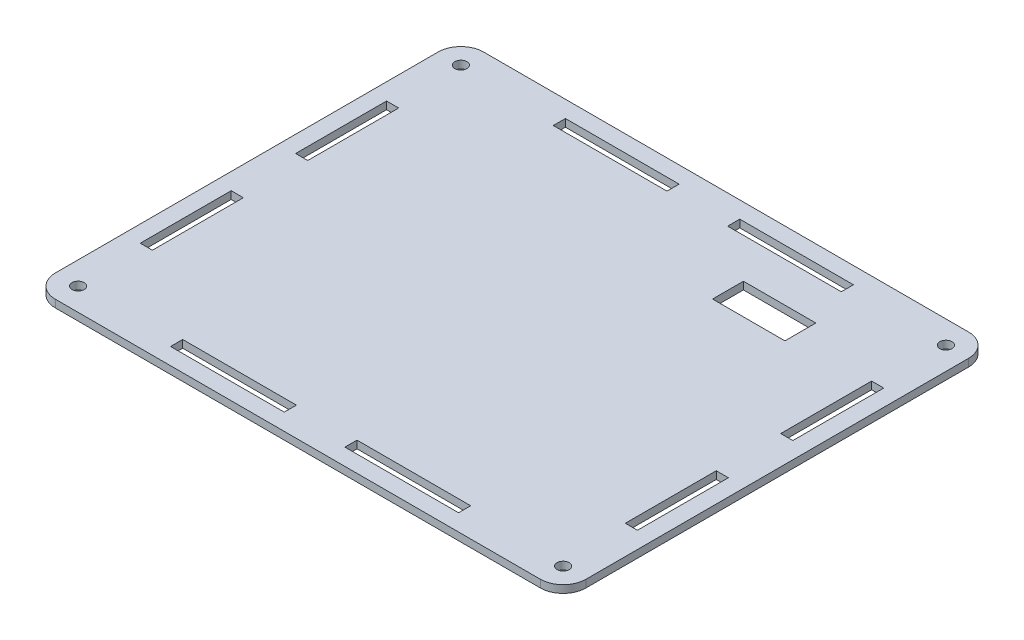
ISO-10303-21;
HEADER;
FILE_DESCRIPTION(('STEP AP214'),'2;1');
FILE_NAME('part.step','',(''),(''),'','','');
FILE_SCHEMA(('AUTOMOTIVE_DESIGN { 1 0 10303 214 1 1 1 1 }'));
ENDSEC;
DATA;
#1=APPLICATION_CONTEXT('core data for automotive mechanical design processes');
#2=APPLICATION_PROTOCOL_DEFINITION('international standard','automotive_design',2000,#1);
#3=PRODUCT_CONTEXT('',#1,'mechanical');
#4=PRODUCT('Part','Part','',(#3));
#5=PRODUCT_RELATED_PRODUCT_CATEGORY('part','',(#4));
#6=PRODUCT_DEFINITION_FORMATION('','',#4);
#7=PRODUCT_DEFINITION_CONTEXT('part definition',#1,'design');
#8=PRODUCT_DEFINITION('design','',#6,#7);
#9=PRODUCT_DEFINITION_SHAPE('','',#8);
#10=(LENGTH_UNIT() NAMED_UNIT(*) SI_UNIT(.MILLI.,.METRE.));
#11=(NAMED_UNIT(*) PLANE_ANGLE_UNIT() SI_UNIT($,.RADIAN.));
#12=(NAMED_UNIT(*) SI_UNIT($,.STERADIAN.) SOLID_ANGLE_UNIT());
#13=UNCERTAINTY_MEASURE_WITH_UNIT(LENGTH_MEASURE(1.E-05),#10,'distance_accuracy_value','');
#14=(GEOMETRIC_REPRESENTATION_CONTEXT(3) GLOBAL_UNCERTAINTY_ASSIGNED_CONTEXT((#13)) GLOBAL_UNIT_ASSIGNED_CONTEXT((#10,
#11,#12)) REPRESENTATION_CONTEXT('',''));
#15=CARTESIAN_POINT('',(0.,0.,0.));
#16=DIRECTION('',(0.,0.,1.));
#17=DIRECTION('',(1.,0.,0.));
#18=AXIS2_PLACEMENT_3D('',#15,#16,#17);
#19=CARTESIAN_POINT('',(0.,2.,0.));
#20=DIRECTION('',(0.,-1.,0.));
#21=DIRECTION('',(0.,0.,-1.));
#22=AXIS2_PLACEMENT_3D('',#19,#20,#21);
#23=PLANE('',#22);
#24=DIRECTION('',(0.,0.,-1.));
#25=VECTOR('',#24,1.);
#26=CARTESIAN_POINT('',(135.6,2.,-89.));
#27=LINE('',#26,#25);
#28=CARTESIAN_POINT('',(135.6,2.,-65.));
#29=VERTEX_POINT('',#28);
#30=CARTESIAN_POINT('',(135.6,2.,-89.));
#31=VERTEX_POINT('',#30);
#32=EDGE_CURVE('E358',#29,#31,#27,.T.);
#33=ORIENTED_EDGE('',*,*,#32,.F.);
#34=DIRECTION('',(1.,0.,0.));
#35=VECTOR('',#34,1.);
#36=CARTESIAN_POINT('',(135.6,2.,-65.));
#37=LINE('',#36,#35);
#38=CARTESIAN_POINT('',(132.4,2.,-65.));
#39=VERTEX_POINT('',#38);
#40=EDGE_CURVE('E366',#39,#29,#37,.T.);
#41=ORIENTED_EDGE('',*,*,#40,.F.);
#42=DIRECTION('',(0.,0.,1.));
#43=VECTOR('',#42,1.);
#44=CARTESIAN_POINT('',(132.4,2.,-89.));
#45=LINE('',#44,#43);
#46=CARTESIAN_POINT('',(132.4,2.,-89.));
#47=VERTEX_POINT('',#46);
#48=EDGE_CURVE('E363',#47,#39,#45,.T.);
#49=ORIENTED_EDGE('',*,*,#48,.F.);
#50=DIRECTION('',(-1.,0.,0.));
#51=VECTOR('',#50,1.);
#52=CARTESIAN_POINT('',(135.6,2.,-89.));
#53=LINE('',#52,#51);
#54=EDGE_CURVE('E360',#31,#47,#53,.T.);
#55=ORIENTED_EDGE('',*,*,#54,.F.);
#56=EDGE_LOOP('',(#33,#41,#49,#55));
#57=FACE_BOUND('',#56,.T.);
#58=DIRECTION('',(0.,0.,1.));
#59=VECTOR('',#58,1.);
#60=CARTESIAN_POINT('',(4.4,2.,-89.));
#61=LINE('',#60,#59);
#62=CARTESIAN_POINT('',(4.4,2.,-89.));
#63=VERTEX_POINT('',#62);
#64=CARTESIAN_POINT('',(4.4,2.,-65.));
#65=VERTEX_POINT('',#64);
#66=EDGE_CURVE('E420',#63,#65,#61,.T.);
#67=ORIENTED_EDGE('',*,*,#66,.F.);
#68=DIRECTION('',(-1.,0.,0.));
#69=VECTOR('',#68,1.);
#70=CARTESIAN_POINT('',(4.4,2.,-89.));
#71=LINE('',#70,#69);
#72=CARTESIAN_POINT('',(7.6,2.,-89.));
#73=VERTEX_POINT('',#72);
#74=EDGE_CURVE('E428',#73,#63,#71,.T.);
#75=ORIENTED_EDGE('',*,*,#74,.F.);
#76=DIRECTION('',(0.,0.,-1.));
#77=VECTOR('',#76,1.);
#78=CARTESIAN_POINT('',(7.6,2.,-89.));
#79=LINE('',#78,#77);
#80=CARTESIAN_POINT('',(7.6,2.,-65.));
#81=VERTEX_POINT('',#80);
#82=EDGE_CURVE('E425',#81,#73,#79,.T.);
#83=ORIENTED_EDGE('',*,*,#82,.F.);
#84=DIRECTION('',(1.,0.,0.));
#85=VECTOR('',#84,1.);
#86=CARTESIAN_POINT('',(4.4,2.,-65.));
#87=LINE('',#86,#85);
#88=EDGE_CURVE('E422',#65,#81,#87,.T.);
#89=ORIENTED_EDGE('',*,*,#88,.F.);
#90=EDGE_LOOP('',(#67,#75,#83,#89));
#91=FACE_BOUND('',#90,.T.);
#92=DIRECTION('',(0.,0.,1.));
#93=VECTOR('',#92,1.);
#94=CARTESIAN_POINT('',(32.,2.,-7.60000000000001));
#95=LINE('',#94,#93);
#96=CARTESIAN_POINT('',(32.,2.,-7.60000000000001));
#97=VERTEX_POINT('',#96);
#98=CARTESIAN_POINT('',(32.,2.,-4.39999999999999));
#99=VERTEX_POINT('',#98);
#100=EDGE_CURVE('E482',#97,#99,#95,.T.);
#101=ORIENTED_EDGE('',*,*,#100,.F.);
#102=DIRECTION('',(-1.,0.,0.));
#103=VECTOR('',#102,1.);
#104=CARTESIAN_POINT('',(32.,2.,-7.60000000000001));
#105=LINE('',#104,#103);
#106=CARTESIAN_POINT('',(62.,2.,-7.60000000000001));
#107=VERTEX_POINT('',#106);
#108=EDGE_CURVE('E490',#107,#97,#105,.T.);
#109=ORIENTED_EDGE('',*,*,#108,.F.);
#110=DIRECTION('',(0.,0.,-1.));
#111=VECTOR('',#110,1.);
#112=CARTESIAN_POINT('',(62.,2.,-7.60000000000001));
#113=LINE('',#112,#111);
#114=CARTESIAN_POINT('',(62.,2.,-4.39999999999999));
#115=VERTEX_POINT('',#114);
#116=EDGE_CURVE('E487',#115,#107,#113,.T.);
#117=ORIENTED_EDGE('',*,*,#116,.F.);
#118=DIRECTION('',(1.,0.,0.));
#119=VECTOR('',#118,1.);
#120=CARTESIAN_POINT('',(32.,2.,-4.39999999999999));
#121=LINE('',#120,#119);
#122=EDGE_CURVE('E484',#99,#115,#121,.T.);
#123=ORIENTED_EDGE('',*,*,#122,.F.);
#124=EDGE_LOOP('',(#101,#109,#117,#123));
#125=FACE_BOUND('',#124,.T.);
#126=DIRECTION('',(0.,0.,1.));
#127=VECTOR('',#126,1.);
#128=CARTESIAN_POINT('',(32.,2.,-108.6));
#129=LINE('',#128,#127);
#130=CARTESIAN_POINT('',(32.,2.,-108.6));
#131=VERTEX_POINT('',#130);
#132=CARTESIAN_POINT('',(32.,2.,-105.4));
#133=VERTEX_POINT('',#132);
#134=EDGE_CURVE('E544',#131,#133,#129,.T.);
#135=ORIENTED_EDGE('',*,*,#134,.F.);
#136=DIRECTION('',(-1.,0.,0.));
#137=VECTOR('',#136,1.);
#138=CARTESIAN_POINT('',(32.,2.,-108.6));
#139=LINE('',#138,#137);
#140=CARTESIAN_POINT('',(62.,2.,-108.6));
#141=VERTEX_POINT('',#140);
#142=EDGE_CURVE('E552',#141,#131,#139,.T.);
#143=ORIENTED_EDGE('',*,*,#142,.F.);
#144=DIRECTION('',(0.,0.,-1.));
#145=VECTOR('',#144,1.);
#146=CARTESIAN_POINT('',(62.,2.,-108.6));
#147=LINE('',#146,#145);
#148=CARTESIAN_POINT('',(62.,2.,-105.4));
#149=VERTEX_POINT('',#148);
#150=EDGE_CURVE('E549',#149,#141,#147,.T.);
#151=ORIENTED_EDGE('',*,*,#150,.F.);
#152=DIRECTION('',(1.,0.,0.));
#153=VECTOR('',#152,1.);
#154=CARTESIAN_POINT('',(32.,2.,-105.4));
#155=LINE('',#154,#153);
#156=EDGE_CURVE('E546',#133,#149,#155,.T.);
#157=ORIENTED_EDGE('',*,*,#156,.F.);
#158=EDGE_LOOP('',(#135,#143,#151,#157));
#159=FACE_BOUND('',#158,.T.);
#160=DIRECTION('',(0.,0.,-1.));
#161=VECTOR('',#160,1.);
#162=CARTESIAN_POINT('',(140.,2.,0.));
#163=LINE('',#162,#161);
#164=CARTESIAN_POINT('',(140.,2.,-6.));
#165=VERTEX_POINT('',#164);
#166=CARTESIAN_POINT('',(140.,2.,-107.));
#167=VERTEX_POINT('',#166);
#168=EDGE_CURVE('E636',#165,#167,#163,.T.);
#169=ORIENTED_EDGE('',*,*,#168,.T.);
#170=CARTESIAN_POINT('',(134.,2.,-107.));
#171=DIRECTION('',(0.,-1.,0.));
#172=DIRECTION('',(0.,0.,-1.));
#173=AXIS2_PLACEMENT_3D('',#170,#171,#172);
#174=CIRCLE('',#173,6.);
#175=CARTESIAN_POINT('',(134.,2.,-113.));
#176=VERTEX_POINT('',#175);
#177=EDGE_CURVE('E41',#167,#176,#174,.F.);
#178=ORIENTED_EDGE('',*,*,#177,.T.);
#179=DIRECTION('',(-1.,0.,0.));
#180=VECTOR('',#179,1.);
#181=CARTESIAN_POINT('',(0.,2.,-113.));
#182=LINE('',#181,#180);
#183=CARTESIAN_POINT('',(6.,2.,-113.));
#184=VERTEX_POINT('',#183);
#185=EDGE_CURVE('E638',#176,#184,#182,.T.);
#186=ORIENTED_EDGE('',*,*,#185,.T.);
#187=CARTESIAN_POINT('',(6.,2.,-107.));
#188=DIRECTION('',(0.,-1.,0.));
#189=DIRECTION('',(0.,0.,-1.));
#190=AXIS2_PLACEMENT_3D('',#187,#188,#189);
#191=CIRCLE('',#190,6.);
#192=CARTESIAN_POINT('',(0.,2.,-107.));
#193=VERTEX_POINT('',#192);
#194=EDGE_CURVE('E656',#184,#193,#191,.F.);
#195=ORIENTED_EDGE('',*,*,#194,.T.);
#196=DIRECTION('',(0.,0.,1.));
#197=VECTOR('',#196,1.);
#198=CARTESIAN_POINT('',(0.,2.,0.));
#199=LINE('',#198,#197);
#200=CARTESIAN_POINT('',(0.,2.,-6.));
#201=VERTEX_POINT('',#200);
#202=EDGE_CURVE('E630',#193,#201,#199,.T.);
#203=ORIENTED_EDGE('',*,*,#202,.T.);
#204=CARTESIAN_POINT('',(6.,2.,-6.));
#205=DIRECTION('',(0.,-1.,0.));
#206=DIRECTION('',(0.,0.,-1.));
#207=AXIS2_PLACEMENT_3D('',#204,#205,#206);
#208=CIRCLE('',#207,6.);
#209=CARTESIAN_POINT('',(6.,2.,0.));
#210=VERTEX_POINT('',#209);
#211=EDGE_CURVE('E665',#201,#210,#208,.F.);
#212=ORIENTED_EDGE('',*,*,#211,.T.);
#213=DIRECTION('',(1.,0.,0.));
#214=VECTOR('',#213,1.);
#215=CARTESIAN_POINT('',(0.,2.,0.));
#216=LINE('',#215,#214);
#217=CARTESIAN_POINT('',(134.,2.,0.));
#218=VERTEX_POINT('',#217);
#219=EDGE_CURVE('E633',#210,#218,#216,.T.);
#220=ORIENTED_EDGE('',*,*,#219,.T.);
#221=CARTESIAN_POINT('',(134.,2.,-6.));
#222=DIRECTION('',(0.,-1.,0.));
#223=DIRECTION('',(0.,0.,-1.));
#224=AXIS2_PLACEMENT_3D('',#221,#222,#223);
#225=CIRCLE('',#224,6.);
#226=EDGE_CURVE('E678',#218,#165,#225,.F.);
#227=ORIENTED_EDGE('',*,*,#226,.T.);
#228=EDGE_LOOP('',(#169,#178,#186,#195,#203,#212,#220,#227));
#229=FACE_BOUND('',#228,.T.);
#230=DIRECTION('',(0.,0.,-1.));
#231=VECTOR('',#230,1.);
#232=CARTESIAN_POINT('',(135.6,2.,-48.));
#233=LINE('',#232,#231);
#234=CARTESIAN_POINT('',(135.6,2.,-24.));
#235=VERTEX_POINT('',#234);
#236=CARTESIAN_POINT('',(135.6,2.,-48.));
#237=VERTEX_POINT('',#236);
#238=EDGE_CURVE('E599',#235,#237,#233,.T.);
#239=ORIENTED_EDGE('',*,*,#238,.F.);
#240=DIRECTION('',(1.,0.,0.));
#241=VECTOR('',#240,1.);
#242=CARTESIAN_POINT('',(135.6,2.,-24.));
#243=LINE('',#242,#241);
#244=CARTESIAN_POINT('',(132.4,2.,-24.));
#245=VERTEX_POINT('',#244);
#246=EDGE_CURVE('E607',#245,#235,#243,.T.);
#247=ORIENTED_EDGE('',*,*,#246,.F.);
#248=DIRECTION('',(0.,0.,1.));
#249=VECTOR('',#248,1.);
#250=CARTESIAN_POINT('',(132.4,2.,-48.));
#251=LINE('',#250,#249);
#252=CARTESIAN_POINT('',(132.4,2.,-48.));
#253=VERTEX_POINT('',#252);
#254=EDGE_CURVE('E604',#253,#245,#251,.T.);
#255=ORIENTED_EDGE('',*,*,#254,.F.);
#256=DIRECTION('',(-1.,0.,0.));
#257=VECTOR('',#256,1.);
#258=CARTESIAN_POINT('',(135.6,2.,-48.));
#259=LINE('',#258,#257);
#260=EDGE_CURVE('E601',#237,#253,#259,.T.);
#261=ORIENTED_EDGE('',*,*,#260,.F.);
#262=EDGE_LOOP('',(#239,#247,#255,#261));
#263=FACE_BOUND('',#262,.T.);
#264=CARTESIAN_POINT('',(6.00000000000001,2.,-107.));
#265=DIRECTION('',(0.,1.,0.));
#266=DIRECTION('',(0.,0.,1.));
#267=AXIS2_PLACEMENT_3D('',#264,#265,#266);
#268=CIRCLE('',#267,1.60000000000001);
#269=CARTESIAN_POINT('',(6.00000000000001,2.,-105.4));
#270=VERTEX_POINT('',#269);
#271=EDGE_CURVE('E593',#270,#270,#268,.T.);
#272=ORIENTED_EDGE('',*,*,#271,.F.);
#273=EDGE_LOOP('',(#272));
#274=FACE_BOUND('',#273,.T.);
#275=CARTESIAN_POINT('',(134.,2.,-107.));
#276=DIRECTION('',(0.,1.,0.));
#277=DIRECTION('',(0.,0.,1.));
#278=AXIS2_PLACEMENT_3D('',#275,#276,#277);
#279=CIRCLE('',#278,1.59999999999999);
#280=CARTESIAN_POINT('',(134.,2.,-105.4));
#281=VERTEX_POINT('',#280);
#282=EDGE_CURVE('E587',#281,#281,#279,.T.);
#283=ORIENTED_EDGE('',*,*,#282,.F.);
#284=EDGE_LOOP('',(#283));
#285=FACE_BOUND('',#284,.T.);
#286=CARTESIAN_POINT('',(134.,2.,-6.));
#287=DIRECTION('',(0.,1.,0.));
#288=DIRECTION('',(0.,0.,1.));
#289=AXIS2_PLACEMENT_3D('',#286,#287,#288);
#290=CIRCLE('',#289,1.59999999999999);
#291=CARTESIAN_POINT('',(134.,2.,-4.40000000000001));
#292=VERTEX_POINT('',#291);
#293=EDGE_CURVE('E581',#292,#292,#290,.T.);
#294=ORIENTED_EDGE('',*,*,#293,.F.);
#295=EDGE_LOOP('',(#294));
#296=FACE_BOUND('',#295,.T.);
#297=CARTESIAN_POINT('',(6.,2.,-6.));
#298=DIRECTION('',(0.,1.,0.));
#299=DIRECTION('',(0.,0.,1.));
#300=AXIS2_PLACEMENT_3D('',#297,#298,#299);
#301=CIRCLE('',#300,1.6);
#302=CARTESIAN_POINT('',(6.,2.,-4.4));
#303=VERTEX_POINT('',#302);
#304=EDGE_CURVE('E575',#303,#303,#301,.T.);
#305=ORIENTED_EDGE('',*,*,#304,.F.);
#306=EDGE_LOOP('',(#305));
#307=FACE_BOUND('',#306,.T.);
#308=DIRECTION('',(-1.,0.,0.));
#309=VECTOR('',#308,1.);
#310=CARTESIAN_POINT('',(108.,2.,-7.60000000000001));
#311=LINE('',#310,#309);
#312=CARTESIAN_POINT('',(108.,2.,-7.60000000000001));
#313=VERTEX_POINT('',#312);
#314=CARTESIAN_POINT('',(78.,2.,-7.60000000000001));
#315=VERTEX_POINT('',#314);
#316=EDGE_CURVE('E513',#313,#315,#311,.T.);
#317=ORIENTED_EDGE('',*,*,#316,.F.);
#318=DIRECTION('',(0.,0.,-1.));
#319=VECTOR('',#318,1.);
#320=CARTESIAN_POINT('',(108.,2.,-7.60000000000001));
#321=LINE('',#320,#319);
#322=CARTESIAN_POINT('',(108.,2.,-4.39999999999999));
#323=VERTEX_POINT('',#322);
#324=EDGE_CURVE('E521',#323,#313,#321,.T.);
#325=ORIENTED_EDGE('',*,*,#324,.F.);
#326=DIRECTION('',(1.,0.,0.));
#327=VECTOR('',#326,1.);
#328=CARTESIAN_POINT('',(108.,2.,-4.39999999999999));
#329=LINE('',#328,#327);
#330=CARTESIAN_POINT('',(78.,2.,-4.39999999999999));
#331=VERTEX_POINT('',#330);
#332=EDGE_CURVE('E518',#331,#323,#329,.T.);
#333=ORIENTED_EDGE('',*,*,#332,.F.);
#334=DIRECTION('',(0.,0.,1.));
#335=VECTOR('',#334,1.);
#336=CARTESIAN_POINT('',(78.,2.,-7.60000000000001));
#337=LINE('',#336,#335);
#338=EDGE_CURVE('E515',#315,#331,#337,.T.);
#339=ORIENTED_EDGE('',*,*,#338,.F.);
#340=EDGE_LOOP('',(#317,#325,#333,#339));
#341=FACE_BOUND('',#340,.T.);
#342=DIRECTION('',(0.,0.,-1.));
#343=VECTOR('',#342,1.);
#344=CARTESIAN_POINT('',(108.,2.,-108.6));
#345=LINE('',#344,#343);
#346=CARTESIAN_POINT('',(108.,2.,-105.4));
#347=VERTEX_POINT('',#346);
#348=CARTESIAN_POINT('',(108.,2.,-108.6));
#349=VERTEX_POINT('',#348);
#350=EDGE_CURVE('E451',#347,#349,#345,.T.);
#351=ORIENTED_EDGE('',*,*,#350,.F.);
#352=DIRECTION('',(1.,0.,0.));
#353=VECTOR('',#352,1.);
#354=CARTESIAN_POINT('',(108.,2.,-105.4));
#355=LINE('',#354,#353);
#356=CARTESIAN_POINT('',(78.,2.,-105.4));
#357=VERTEX_POINT('',#356);
#358=EDGE_CURVE('E459',#357,#347,#355,.T.);
#359=ORIENTED_EDGE('',*,*,#358,.F.);
#360=DIRECTION('',(0.,0.,1.));
#361=VECTOR('',#360,1.);
#362=CARTESIAN_POINT('',(78.,2.,-108.6));
#363=LINE('',#362,#361);
#364=CARTESIAN_POINT('',(78.,2.,-108.6));
#365=VERTEX_POINT('',#364);
#366=EDGE_CURVE('E456',#365,#357,#363,.T.);
#367=ORIENTED_EDGE('',*,*,#366,.F.);
#368=DIRECTION('',(-1.,0.,0.));
#369=VECTOR('',#368,1.);
#370=CARTESIAN_POINT('',(108.,2.,-108.6));
#371=LINE('',#370,#369);
#372=EDGE_CURVE('E453',#349,#365,#371,.T.);
#373=ORIENTED_EDGE('',*,*,#372,.F.);
#374=EDGE_LOOP('',(#351,#359,#367,#373));
#375=FACE_BOUND('',#374,.T.);
#376=DIRECTION('',(0.,0.,1.));
#377=VECTOR('',#376,1.);
#378=CARTESIAN_POINT('',(4.4,2.,-48.));
#379=LINE('',#378,#377);
#380=CARTESIAN_POINT('',(4.4,2.,-48.));
#381=VERTEX_POINT('',#380);
#382=CARTESIAN_POINT('',(4.4,2.,-24.));
#383=VERTEX_POINT('',#382);
#384=EDGE_CURVE('E389',#381,#383,#379,.T.);
#385=ORIENTED_EDGE('',*,*,#384,.F.);
#386=DIRECTION('',(-1.,0.,0.));
#387=VECTOR('',#386,1.);
#388=CARTESIAN_POINT('',(4.4,2.,-48.));
#389=LINE('',#388,#387);
#390=CARTESIAN_POINT('',(7.6,2.,-48.));
#391=VERTEX_POINT('',#390);
#392=EDGE_CURVE('E397',#391,#381,#389,.T.);
#393=ORIENTED_EDGE('',*,*,#392,.F.);
#394=DIRECTION('',(0.,0.,-1.));
#395=VECTOR('',#394,1.);
#396=CARTESIAN_POINT('',(7.6,2.,-48.));
#397=LINE('',#396,#395);
#398=CARTESIAN_POINT('',(7.6,2.,-24.));
#399=VERTEX_POINT('',#398);
#400=EDGE_CURVE('E394',#399,#391,#397,.T.);
#401=ORIENTED_EDGE('',*,*,#400,.F.);
#402=DIRECTION('',(1.,0.,0.));
#403=VECTOR('',#402,1.);
#404=CARTESIAN_POINT('',(4.4,2.,-24.));
#405=LINE('',#404,#403);
#406=EDGE_CURVE('E391',#383,#399,#405,.T.);
#407=ORIENTED_EDGE('',*,*,#406,.F.);
#408=EDGE_LOOP('',(#385,#393,#401,#407));
#409=FACE_BOUND('',#408,.T.);
#410=DIRECTION('',(0.,0.,-1.));
#411=VECTOR('',#410,1.);
#412=CARTESIAN_POINT('',(111.77,2.,-94.9));
#413=LINE('',#412,#411);
#414=CARTESIAN_POINT('',(111.77,2.,-86.750253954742));
#415=VERTEX_POINT('',#414);
#416=CARTESIAN_POINT('',(111.77,2.,-94.9));
#417=VERTEX_POINT('',#416);
#418=EDGE_CURVE('E317',#415,#417,#413,.T.);
#419=ORIENTED_EDGE('',*,*,#418,.F.);
#420=DIRECTION('',(1.,0.,0.));
#421=VECTOR('',#420,1.);
#422=CARTESIAN_POINT('',(111.77,2.,-86.750253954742));
#423=LINE('',#422,#421);
#424=CARTESIAN_POINT('',(92.67,2.,-86.750253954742));
#425=VERTEX_POINT('',#424);
#426=EDGE_CURVE('E342',#425,#415,#423,.T.);
#427=ORIENTED_EDGE('',*,*,#426,.F.);
#428=DIRECTION('',(0.,0.,1.));
#429=VECTOR('',#428,1.);
#430=CARTESIAN_POINT('',(92.67,2.,-94.9));
#431=LINE('',#430,#429);
#432=CARTESIAN_POINT('',(92.67,2.,-94.9));
#433=VERTEX_POINT('',#432);
#434=EDGE_CURVE('E340',#433,#425,#431,.T.);
#435=ORIENTED_EDGE('',*,*,#434,.F.);
#436=DIRECTION('',(-1.,0.,0.));
#437=VECTOR('',#436,1.);
#438=CARTESIAN_POINT('',(111.77,2.,-94.9));
#439=LINE('',#438,#437);
#440=EDGE_CURVE('E327',#417,#433,#439,.T.);
#441=ORIENTED_EDGE('',*,*,#440,.F.);
#442=EDGE_LOOP('',(#419,#427,#435,#441));
#443=FACE_BOUND('',#442,.T.);
#444=ADVANCED_FACE('F33',(#57,#91,#125,#159,#229,#263,#274,#285,#296,#307,#341,#375,#409,#443),
#23,.F.);
#445=CARTESIAN_POINT('',(0.,0.,0.));
#446=DIRECTION('',(0.,-1.,0.));
#447=DIRECTION('',(0.,0.,-1.));
#448=AXIS2_PLACEMENT_3D('',#445,#446,#447);
#449=PLANE('',#448);
#450=CARTESIAN_POINT('',(134.,0.,-6.));
#451=DIRECTION('',(0.,1.,0.));
#452=DIRECTION('',(0.,0.,1.));
#453=AXIS2_PLACEMENT_3D('',#450,#451,#452);
#454=CIRCLE('',#453,1.59999999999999);
#455=CARTESIAN_POINT('',(134.,0.,-4.40000000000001));
#456=VERTEX_POINT('',#455);
#457=EDGE_CURVE('E578',#456,#456,#454,.T.);
#458=ORIENTED_EDGE('',*,*,#457,.T.);
#459=EDGE_LOOP('',(#458));
#460=FACE_BOUND('',#459,.T.);
#461=CARTESIAN_POINT('',(6.00000000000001,0.,-107.));
#462=DIRECTION('',(0.,1.,0.));
#463=DIRECTION('',(0.,0.,1.));
#464=AXIS2_PLACEMENT_3D('',#461,#462,#463);
#465=CIRCLE('',#464,1.60000000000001);
#466=CARTESIAN_POINT('',(6.00000000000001,0.,-105.4));
#467=VERTEX_POINT('',#466);
#468=EDGE_CURVE('E590',#467,#467,#465,.T.);
#469=ORIENTED_EDGE('',*,*,#468,.T.);
#470=EDGE_LOOP('',(#469));
#471=FACE_BOUND('',#470,.T.);
#472=DIRECTION('',(-1.,0.,0.));
#473=VECTOR('',#472,1.);
#474=CARTESIAN_POINT('',(0.,0.,-113.));
#475=LINE('',#474,#473);
#476=CARTESIAN_POINT('',(134.,0.,-113.));
#477=VERTEX_POINT('',#476);
#478=CARTESIAN_POINT('',(6.,0.,-113.));
#479=VERTEX_POINT('',#478);
#480=EDGE_CURVE('E634',#477,#479,#475,.T.);
#481=ORIENTED_EDGE('',*,*,#480,.F.);
#482=CARTESIAN_POINT('',(134.,0.,-107.));
#483=DIRECTION('',(0.,-1.,0.));
#484=DIRECTION('',(0.,0.,-1.));
#485=AXIS2_PLACEMENT_3D('',#482,#483,#484);
#486=CIRCLE('',#485,6.);
#487=CARTESIAN_POINT('',(140.,0.,-107.));
#488=VERTEX_POINT('',#487);
#489=EDGE_CURVE('E672',#477,#488,#486,.T.);
#490=ORIENTED_EDGE('',*,*,#489,.T.);
#491=DIRECTION('',(0.,0.,-1.));
#492=VECTOR('',#491,1.);
#493=CARTESIAN_POINT('',(140.,0.,0.));
#494=LINE('',#493,#492);
#495=CARTESIAN_POINT('',(140.,0.,-6.));
#496=VERTEX_POINT('',#495);
#497=EDGE_CURVE('E645',#496,#488,#494,.T.);
#498=ORIENTED_EDGE('',*,*,#497,.F.);
#499=CARTESIAN_POINT('',(134.,0.,-6.));
#500=DIRECTION('',(0.,-1.,0.));
#501=DIRECTION('',(0.,0.,-1.));
#502=AXIS2_PLACEMENT_3D('',#499,#500,#501);
#503=CIRCLE('',#502,6.);
#504=CARTESIAN_POINT('',(134.,0.,0.));
#505=VERTEX_POINT('',#504);
#506=EDGE_CURVE('E670',#496,#505,#503,.T.);
#507=ORIENTED_EDGE('',*,*,#506,.T.);
#508=DIRECTION('',(1.,0.,0.));
#509=VECTOR('',#508,1.);
#510=CARTESIAN_POINT('',(0.,0.,0.));
#511=LINE('',#510,#509);
#512=CARTESIAN_POINT('',(6.,0.,0.));
#513=VERTEX_POINT('',#512);
#514=EDGE_CURVE('E643',#513,#505,#511,.T.);
#515=ORIENTED_EDGE('',*,*,#514,.F.);
#516=CARTESIAN_POINT('',(6.,0.,-6.));
#517=DIRECTION('',(0.,-1.,0.));
#518=DIRECTION('',(0.,0.,-1.));
#519=AXIS2_PLACEMENT_3D('',#516,#517,#518);
#520=CIRCLE('',#519,6.);
#521=CARTESIAN_POINT('',(0.,0.,-6.));
#522=VERTEX_POINT('',#521);
#523=EDGE_CURVE('E661',#513,#522,#520,.T.);
#524=ORIENTED_EDGE('',*,*,#523,.T.);
#525=DIRECTION('',(0.,0.,1.));
#526=VECTOR('',#525,1.);
#527=CARTESIAN_POINT('',(0.,0.,0.));
#528=LINE('',#527,#526);
#529=CARTESIAN_POINT('',(0.,0.,-107.));
#530=VERTEX_POINT('',#529);
#531=EDGE_CURVE('E629',#530,#522,#528,.T.);
#532=ORIENTED_EDGE('',*,*,#531,.F.);
#533=CARTESIAN_POINT('',(6.,0.,-107.));
#534=DIRECTION('',(0.,-1.,0.));
#535=DIRECTION('',(0.,0.,-1.));
#536=AXIS2_PLACEMENT_3D('',#533,#534,#535);
#537=CIRCLE('',#536,6.);
#538=EDGE_CURVE('E650',#530,#479,#537,.T.);
#539=ORIENTED_EDGE('',*,*,#538,.T.);
#540=EDGE_LOOP('',(#481,#490,#498,#507,#515,#524,#532,#539));
#541=FACE_BOUND('',#540,.T.);
#542=DIRECTION('',(1.,0.,0.));
#543=VECTOR('',#542,1.);
#544=CARTESIAN_POINT('',(135.6,0.,-24.));
#545=LINE('',#544,#543);
#546=CARTESIAN_POINT('',(132.4,0.,-24.));
#547=VERTEX_POINT('',#546);
#548=CARTESIAN_POINT('',(135.6,0.,-24.));
#549=VERTEX_POINT('',#548);
#550=EDGE_CURVE('E602',#547,#549,#545,.T.);
#551=ORIENTED_EDGE('',*,*,#550,.T.);
#552=DIRECTION('',(0.,0.,-1.));
#553=VECTOR('',#552,1.);
#554=CARTESIAN_POINT('',(135.6,0.,-48.));
#555=LINE('',#554,#553);
#556=CARTESIAN_POINT('',(135.6,0.,-48.));
#557=VERTEX_POINT('',#556);
#558=EDGE_CURVE('E596',#549,#557,#555,.T.);
#559=ORIENTED_EDGE('',*,*,#558,.T.);
#560=DIRECTION('',(-1.,0.,0.));
#561=VECTOR('',#560,1.);
#562=CARTESIAN_POINT('',(135.6,0.,-48.));
#563=LINE('',#562,#561);
#564=CARTESIAN_POINT('',(132.4,0.,-48.));
#565=VERTEX_POINT('',#564);
#566=EDGE_CURVE('E612',#557,#565,#563,.T.);
#567=ORIENTED_EDGE('',*,*,#566,.T.);
#568=DIRECTION('',(0.,0.,1.));
#569=VECTOR('',#568,1.);
#570=CARTESIAN_POINT('',(132.4,0.,-48.));
#571=LINE('',#570,#569);
#572=EDGE_CURVE('E615',#565,#547,#571,.T.);
#573=ORIENTED_EDGE('',*,*,#572,.T.);
#574=EDGE_LOOP('',(#551,#559,#567,#573));
#575=FACE_BOUND('',#574,.T.);
#576=CARTESIAN_POINT('',(134.,0.,-107.));
#577=DIRECTION('',(0.,1.,0.));
#578=DIRECTION('',(0.,0.,1.));
#579=AXIS2_PLACEMENT_3D('',#576,#577,#578);
#580=CIRCLE('',#579,1.59999999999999);
#581=CARTESIAN_POINT('',(134.,0.,-105.4));
#582=VERTEX_POINT('',#581);
#583=EDGE_CURVE('E584',#582,#582,#580,.T.);
#584=ORIENTED_EDGE('',*,*,#583,.T.);
#585=EDGE_LOOP('',(#584));
#586=FACE_BOUND('',#585,.T.);
#587=CARTESIAN_POINT('',(6.,0.,-6.));
#588=DIRECTION('',(0.,1.,0.));
#589=DIRECTION('',(0.,0.,1.));
#590=AXIS2_PLACEMENT_3D('',#587,#588,#589);
#591=CIRCLE('',#590,1.6);
#592=CARTESIAN_POINT('',(6.,0.,-4.4));
#593=VERTEX_POINT('',#592);
#594=EDGE_CURVE('E574',#593,#593,#591,.T.);
#595=ORIENTED_EDGE('',*,*,#594,.T.);
#596=EDGE_LOOP('',(#595));
#597=FACE_BOUND('',#596,.T.);
#598=DIRECTION('',(-1.,0.,0.));
#599=VECTOR('',#598,1.);
#600=CARTESIAN_POINT('',(32.,0.,-108.6));
#601=LINE('',#600,#599);
#602=CARTESIAN_POINT('',(62.,0.,-108.6));
#603=VERTEX_POINT('',#602);
#604=CARTESIAN_POINT('',(32.,0.,-108.6));
#605=VERTEX_POINT('',#604);
#606=EDGE_CURVE('E547',#603,#605,#601,.T.);
#607=ORIENTED_EDGE('',*,*,#606,.T.);
#608=DIRECTION('',(0.,0.,1.));
#609=VECTOR('',#608,1.);
#610=CARTESIAN_POINT('',(32.,0.,-108.6));
#611=LINE('',#610,#609);
#612=CARTESIAN_POINT('',(32.,0.,-105.4));
#613=VERTEX_POINT('',#612);
#614=EDGE_CURVE('E543',#605,#613,#611,.T.);
#615=ORIENTED_EDGE('',*,*,#614,.T.);
#616=DIRECTION('',(1.,0.,0.));
#617=VECTOR('',#616,1.);
#618=CARTESIAN_POINT('',(32.,0.,-105.4));
#619=LINE('',#618,#617);
#620=CARTESIAN_POINT('',(62.,0.,-105.4));
#621=VERTEX_POINT('',#620);
#622=EDGE_CURVE('E557',#613,#621,#619,.T.);
#623=ORIENTED_EDGE('',*,*,#622,.T.);
#624=DIRECTION('',(0.,0.,-1.));
#625=VECTOR('',#624,1.);
#626=CARTESIAN_POINT('',(62.,0.,-108.6));
#627=LINE('',#626,#625);
#628=EDGE_CURVE('E560',#621,#603,#627,.T.);
#629=ORIENTED_EDGE('',*,*,#628,.T.);
#630=EDGE_LOOP('',(#607,#615,#623,#629));
#631=FACE_BOUND('',#630,.T.);
#632=DIRECTION('',(0.,0.,-1.));
#633=VECTOR('',#632,1.);
#634=CARTESIAN_POINT('',(108.,0.,-7.60000000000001));
#635=LINE('',#634,#633);
#636=CARTESIAN_POINT('',(108.,0.,-4.39999999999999));
#637=VERTEX_POINT('',#636);
#638=CARTESIAN_POINT('',(108.,0.,-7.60000000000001));
#639=VERTEX_POINT('',#638);
#640=EDGE_CURVE('E516',#637,#639,#635,.T.);
#641=ORIENTED_EDGE('',*,*,#640,.T.);
#642=DIRECTION('',(-1.,0.,0.));
#643=VECTOR('',#642,1.);
#644=CARTESIAN_POINT('',(108.,0.,-7.60000000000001));
#645=LINE('',#644,#643);
#646=CARTESIAN_POINT('',(78.,0.,-7.60000000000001));
#647=VERTEX_POINT('',#646);
#648=EDGE_CURVE('E512',#639,#647,#645,.T.);
#649=ORIENTED_EDGE('',*,*,#648,.T.);
#650=DIRECTION('',(0.,0.,1.));
#651=VECTOR('',#650,1.);
#652=CARTESIAN_POINT('',(78.,0.,-7.60000000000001));
#653=LINE('',#652,#651);
#654=CARTESIAN_POINT('',(78.,0.,-4.39999999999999));
#655=VERTEX_POINT('',#654);
#656=EDGE_CURVE('E526',#647,#655,#653,.T.);
#657=ORIENTED_EDGE('',*,*,#656,.T.);
#658=DIRECTION('',(1.,0.,0.));
#659=VECTOR('',#658,1.);
#660=CARTESIAN_POINT('',(108.,0.,-4.39999999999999));
#661=LINE('',#660,#659);
#662=EDGE_CURVE('E529',#655,#637,#661,.T.);
#663=ORIENTED_EDGE('',*,*,#662,.T.);
#664=EDGE_LOOP('',(#641,#649,#657,#663));
#665=FACE_BOUND('',#664,.T.);
#666=DIRECTION('',(-1.,0.,0.));
#667=VECTOR('',#666,1.);
#668=CARTESIAN_POINT('',(32.,0.,-7.60000000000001));
#669=LINE('',#668,#667);
#670=CARTESIAN_POINT('',(62.,0.,-7.60000000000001));
#671=VERTEX_POINT('',#670);
#672=CARTESIAN_POINT('',(32.,0.,-7.60000000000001));
#673=VERTEX_POINT('',#672);
#674=EDGE_CURVE('E485',#671,#673,#669,.T.);
#675=ORIENTED_EDGE('',*,*,#674,.T.);
#676=DIRECTION('',(0.,0.,1.));
#677=VECTOR('',#676,1.);
#678=CARTESIAN_POINT('',(32.,0.,-7.60000000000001));
#679=LINE('',#678,#677);
#680=CARTESIAN_POINT('',(32.,0.,-4.39999999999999));
#681=VERTEX_POINT('',#680);
#682=EDGE_CURVE('E481',#673,#681,#679,.T.);
#683=ORIENTED_EDGE('',*,*,#682,.T.);
#684=DIRECTION('',(1.,0.,0.));
#685=VECTOR('',#684,1.);
#686=CARTESIAN_POINT('',(32.,0.,-4.39999999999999));
#687=LINE('',#686,#685);
#688=CARTESIAN_POINT('',(62.,0.,-4.39999999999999));
#689=VERTEX_POINT('',#688);
#690=EDGE_CURVE('E495',#681,#689,#687,.T.);
#691=ORIENTED_EDGE('',*,*,#690,.T.);
#692=DIRECTION('',(0.,0.,-1.));
#693=VECTOR('',#692,1.);
#694=CARTESIAN_POINT('',(62.,0.,-7.60000000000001));
#695=LINE('',#694,#693);
#696=EDGE_CURVE('E498',#689,#671,#695,.T.);
#697=ORIENTED_EDGE('',*,*,#696,.T.);
#698=EDGE_LOOP('',(#675,#683,#691,#697));
#699=FACE_BOUND('',#698,.T.);
#700=DIRECTION('',(1.,0.,0.));
#701=VECTOR('',#700,1.);
#702=CARTESIAN_POINT('',(108.,0.,-105.4));
#703=LINE('',#702,#701);
#704=CARTESIAN_POINT('',(78.,0.,-105.4));
#705=VERTEX_POINT('',#704);
#706=CARTESIAN_POINT('',(108.,0.,-105.4));
#707=VERTEX_POINT('',#706);
#708=EDGE_CURVE('E454',#705,#707,#703,.T.);
#709=ORIENTED_EDGE('',*,*,#708,.T.);
#710=DIRECTION('',(0.,0.,-1.));
#711=VECTOR('',#710,1.);
#712=CARTESIAN_POINT('',(108.,0.,-108.6));
#713=LINE('',#712,#711);
#714=CARTESIAN_POINT('',(108.,0.,-108.6));
#715=VERTEX_POINT('',#714);
#716=EDGE_CURVE('E450',#707,#715,#713,.T.);
#717=ORIENTED_EDGE('',*,*,#716,.T.);
#718=DIRECTION('',(-1.,0.,0.));
#719=VECTOR('',#718,1.);
#720=CARTESIAN_POINT('',(108.,0.,-108.6));
#721=LINE('',#720,#719);
#722=CARTESIAN_POINT('',(78.,0.,-108.6));
#723=VERTEX_POINT('',#722);
#724=EDGE_CURVE('E464',#715,#723,#721,.T.);
#725=ORIENTED_EDGE('',*,*,#724,.T.);
#726=DIRECTION('',(0.,0.,1.));
#727=VECTOR('',#726,1.);
#728=CARTESIAN_POINT('',(78.,0.,-108.6));
#729=LINE('',#728,#727);
#730=EDGE_CURVE('E467',#723,#705,#729,.T.);
#731=ORIENTED_EDGE('',*,*,#730,.T.);
#732=EDGE_LOOP('',(#709,#717,#725,#731));
#733=FACE_BOUND('',#732,.T.);
#734=DIRECTION('',(-1.,0.,0.));
#735=VECTOR('',#734,1.);
#736=CARTESIAN_POINT('',(4.4,0.,-89.));
#737=LINE('',#736,#735);
#738=CARTESIAN_POINT('',(7.6,0.,-89.));
#739=VERTEX_POINT('',#738);
#740=CARTESIAN_POINT('',(4.4,0.,-89.));
#741=VERTEX_POINT('',#740);
#742=EDGE_CURVE('E423',#739,#741,#737,.T.);
#743=ORIENTED_EDGE('',*,*,#742,.T.);
#744=DIRECTION('',(0.,0.,1.));
#745=VECTOR('',#744,1.);
#746=CARTESIAN_POINT('',(4.4,0.,-89.));
#747=LINE('',#746,#745);
#748=CARTESIAN_POINT('',(4.4,0.,-65.));
#749=VERTEX_POINT('',#748);
#750=EDGE_CURVE('E419',#741,#749,#747,.T.);
#751=ORIENTED_EDGE('',*,*,#750,.T.);
#752=DIRECTION('',(1.,0.,0.));
#753=VECTOR('',#752,1.);
#754=CARTESIAN_POINT('',(4.4,0.,-65.));
#755=LINE('',#754,#753);
#756=CARTESIAN_POINT('',(7.6,0.,-65.));
#757=VERTEX_POINT('',#756);
#758=EDGE_CURVE('E433',#749,#757,#755,.T.);
#759=ORIENTED_EDGE('',*,*,#758,.T.);
#760=DIRECTION('',(0.,0.,-1.));
#761=VECTOR('',#760,1.);
#762=CARTESIAN_POINT('',(7.6,0.,-89.));
#763=LINE('',#762,#761);
#764=EDGE_CURVE('E436',#757,#739,#763,.T.);
#765=ORIENTED_EDGE('',*,*,#764,.T.);
#766=EDGE_LOOP('',(#743,#751,#759,#765));
#767=FACE_BOUND('',#766,.T.);
#768=DIRECTION('',(-1.,0.,0.));
#769=VECTOR('',#768,1.);
#770=CARTESIAN_POINT('',(4.4,0.,-48.));
#771=LINE('',#770,#769);
#772=CARTESIAN_POINT('',(7.6,0.,-48.));
#773=VERTEX_POINT('',#772);
#774=CARTESIAN_POINT('',(4.4,0.,-48.));
#775=VERTEX_POINT('',#774);
#776=EDGE_CURVE('E392',#773,#775,#771,.T.);
#777=ORIENTED_EDGE('',*,*,#776,.T.);
#778=DIRECTION('',(0.,0.,1.));
#779=VECTOR('',#778,1.);
#780=CARTESIAN_POINT('',(4.4,0.,-48.));
#781=LINE('',#780,#779);
#782=CARTESIAN_POINT('',(4.4,0.,-24.));
#783=VERTEX_POINT('',#782);
#784=EDGE_CURVE('E388',#775,#783,#781,.T.);
#785=ORIENTED_EDGE('',*,*,#784,.T.);
#786=DIRECTION('',(1.,0.,0.));
#787=VECTOR('',#786,1.);
#788=CARTESIAN_POINT('',(4.4,0.,-24.));
#789=LINE('',#788,#787);
#790=CARTESIAN_POINT('',(7.6,0.,-24.));
#791=VERTEX_POINT('',#790);
#792=EDGE_CURVE('E402',#783,#791,#789,.T.);
#793=ORIENTED_EDGE('',*,*,#792,.T.);
#794=DIRECTION('',(0.,0.,-1.));
#795=VECTOR('',#794,1.);
#796=CARTESIAN_POINT('',(7.6,0.,-48.));
#797=LINE('',#796,#795);
#798=EDGE_CURVE('E405',#791,#773,#797,.T.);
#799=ORIENTED_EDGE('',*,*,#798,.T.);
#800=EDGE_LOOP('',(#777,#785,#793,#799));
#801=FACE_BOUND('',#800,.T.);
#802=DIRECTION('',(1.,0.,0.));
#803=VECTOR('',#802,1.);
#804=CARTESIAN_POINT('',(135.6,0.,-65.));
#805=LINE('',#804,#803);
#806=CARTESIAN_POINT('',(132.4,0.,-65.));
#807=VERTEX_POINT('',#806);
#808=CARTESIAN_POINT('',(135.6,0.,-65.));
#809=VERTEX_POINT('',#808);
#810=EDGE_CURVE('E361',#807,#809,#805,.T.);
#811=ORIENTED_EDGE('',*,*,#810,.T.);
#812=DIRECTION('',(0.,0.,-1.));
#813=VECTOR('',#812,1.);
#814=CARTESIAN_POINT('',(135.6,0.,-89.));
#815=LINE('',#814,#813);
#816=CARTESIAN_POINT('',(135.6,0.,-89.));
#817=VERTEX_POINT('',#816);
#818=EDGE_CURVE('E335',#809,#817,#815,.T.);
#819=ORIENTED_EDGE('',*,*,#818,.T.);
#820=DIRECTION('',(-1.,0.,0.));
#821=VECTOR('',#820,1.);
#822=CARTESIAN_POINT('',(135.6,0.,-89.));
#823=LINE('',#822,#821);
#824=CARTESIAN_POINT('',(132.4,0.,-89.));
#825=VERTEX_POINT('',#824);
#826=EDGE_CURVE('E371',#817,#825,#823,.T.);
#827=ORIENTED_EDGE('',*,*,#826,.T.);
#828=DIRECTION('',(0.,0.,1.));
#829=VECTOR('',#828,1.);
#830=CARTESIAN_POINT('',(132.4,0.,-89.));
#831=LINE('',#830,#829);
#832=EDGE_CURVE('E374',#825,#807,#831,.T.);
#833=ORIENTED_EDGE('',*,*,#832,.T.);
#834=EDGE_LOOP('',(#811,#819,#827,#833));
#835=FACE_BOUND('',#834,.T.);
#836=DIRECTION('',(1.,0.,0.));
#837=VECTOR('',#836,1.);
#838=CARTESIAN_POINT('',(111.77,0.,-86.750253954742));
#839=LINE('',#838,#837);
#840=CARTESIAN_POINT('',(92.67,0.,-86.750253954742));
#841=VERTEX_POINT('',#840);
#842=CARTESIAN_POINT('',(111.77,0.,-86.750253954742));
#843=VERTEX_POINT('',#842);
#844=EDGE_CURVE('E328',#841,#843,#839,.T.);
#845=ORIENTED_EDGE('',*,*,#844,.T.);
#846=DIRECTION('',(0.,0.,-1.));
#847=VECTOR('',#846,1.);
#848=CARTESIAN_POINT('',(111.77,0.,-94.9));
#849=LINE('',#848,#847);
#850=CARTESIAN_POINT('',(111.77,0.,-94.9));
#851=VERTEX_POINT('',#850);
#852=EDGE_CURVE('E346',#843,#851,#849,.T.);
#853=ORIENTED_EDGE('',*,*,#852,.T.);
#854=DIRECTION('',(-1.,0.,0.));
#855=VECTOR('',#854,1.);
#856=CARTESIAN_POINT('',(111.77,0.,-94.9));
#857=LINE('',#856,#855);
#858=CARTESIAN_POINT('',(92.67,0.,-94.9));
#859=VERTEX_POINT('',#858);
#860=EDGE_CURVE('E334',#851,#859,#857,.T.);
#861=ORIENTED_EDGE('',*,*,#860,.T.);
#862=DIRECTION('',(0.,0.,1.));
#863=VECTOR('',#862,1.);
#864=CARTESIAN_POINT('',(92.67,0.,-94.9));
#865=LINE('',#864,#863);
#866=EDGE_CURVE('E349',#859,#841,#865,.T.);
#867=ORIENTED_EDGE('',*,*,#866,.T.);
#868=EDGE_LOOP('',(#845,#853,#861,#867));
#869=FACE_BOUND('',#868,.T.);
#870=ADVANCED_FACE('F693',(#460,#471,#541,#575,#586,#597,#631,#665,#699,#733,#767,#801,#835,
#869),#449,.T.);
#871=CARTESIAN_POINT('',(0.,2.,0.));
#872=DIRECTION('',(1.,0.,0.));
#873=DIRECTION('',(0.,0.,-1.));
#874=AXIS2_PLACEMENT_3D('',#871,#872,#873);
#875=PLANE('',#874);
#876=ORIENTED_EDGE('',*,*,#531,.T.);
#877=DIRECTION('',(0.,-1.,0.));
#878=VECTOR('',#877,1.);
#879=CARTESIAN_POINT('',(0.,2.,-6.));
#880=LINE('',#879,#878);
#881=EDGE_CURVE('E663',#522,#201,#880,.F.);
#882=ORIENTED_EDGE('',*,*,#881,.T.);
#883=ORIENTED_EDGE('',*,*,#202,.F.);
#884=DIRECTION('',(0.,-1.,0.));
#885=VECTOR('',#884,1.);
#886=CARTESIAN_POINT('',(0.,2.,-107.));
#887=LINE('',#886,#885);
#888=EDGE_CURVE('E640',#193,#530,#887,.T.);
#889=ORIENTED_EDGE('',*,*,#888,.T.);
#890=EDGE_LOOP('',(#876,#882,#883,#889));
#891=FACE_BOUND('',#890,.T.);
#892=ADVANCED_FACE('F708',(#891),#875,.F.);
#893=CARTESIAN_POINT('',(0.,2.,0.));
#894=DIRECTION('',(0.,0.,-1.));
#895=DIRECTION('',(-1.,0.,0.));
#896=AXIS2_PLACEMENT_3D('',#893,#894,#895);
#897=PLANE('',#896);
#898=ORIENTED_EDGE('',*,*,#514,.T.);
#899=DIRECTION('',(0.,-1.,0.));
#900=VECTOR('',#899,1.);
#901=CARTESIAN_POINT('',(134.,2.,0.));
#902=LINE('',#901,#900);
#903=EDGE_CURVE('E11',#505,#218,#902,.F.);
#904=ORIENTED_EDGE('',*,*,#903,.T.);
#905=ORIENTED_EDGE('',*,*,#219,.F.);
#906=DIRECTION('',(0.,-1.,0.));
#907=VECTOR('',#906,1.);
#908=CARTESIAN_POINT('',(6.,2.,0.));
#909=LINE('',#908,#907);
#910=EDGE_CURVE('E658',#210,#513,#909,.T.);
#911=ORIENTED_EDGE('',*,*,#910,.T.);
#912=EDGE_LOOP('',(#898,#904,#905,#911));
#913=FACE_BOUND('',#912,.T.);
#914=ADVANCED_FACE('F700',(#913),#897,.F.);
#915=CARTESIAN_POINT('',(140.,2.,0.));
#916=DIRECTION('',(-1.,0.,0.));
#917=DIRECTION('',(0.,0.,1.));
#918=AXIS2_PLACEMENT_3D('',#915,#916,#917);
#919=PLANE('',#918);
#920=ORIENTED_EDGE('',*,*,#497,.T.);
#921=DIRECTION('',(0.,-1.,0.));
#922=VECTOR('',#921,1.);
#923=CARTESIAN_POINT('',(140.,2.,-107.));
#924=LINE('',#923,#922);
#925=EDGE_CURVE('E54',#488,#167,#924,.F.);
#926=ORIENTED_EDGE('',*,*,#925,.T.);
#927=ORIENTED_EDGE('',*,*,#168,.F.);
#928=DIRECTION('',(0.,-1.,0.));
#929=VECTOR('',#928,1.);
#930=CARTESIAN_POINT('',(140.,2.,-6.));
#931=LINE('',#930,#929);
#932=EDGE_CURVE('E674',#165,#496,#931,.T.);
#933=ORIENTED_EDGE('',*,*,#932,.T.);
#934=EDGE_LOOP('',(#920,#926,#927,#933));
#935=FACE_BOUND('',#934,.T.);
#936=ADVANCED_FACE('F695',(#935),#919,.F.);
#937=CARTESIAN_POINT('',(0.,2.,-113.));
#938=DIRECTION('',(0.,0.,1.));
#939=DIRECTION('',(1.,0.,0.));
#940=AXIS2_PLACEMENT_3D('',#937,#938,#939);
#941=PLANE('',#940);
#942=ORIENTED_EDGE('',*,*,#185,.F.);
#943=DIRECTION('',(0.,-1.,0.));
#944=VECTOR('',#943,1.);
#945=CARTESIAN_POINT('',(134.,2.,-113.));
#946=LINE('',#945,#944);
#947=EDGE_CURVE('E667',#176,#477,#946,.T.);
#948=ORIENTED_EDGE('',*,*,#947,.T.);
#949=ORIENTED_EDGE('',*,*,#480,.T.);
#950=DIRECTION('',(0.,-1.,0.));
#951=VECTOR('',#950,1.);
#952=CARTESIAN_POINT('',(6.,2.,-113.));
#953=LINE('',#952,#951);
#954=EDGE_CURVE('E653',#479,#184,#953,.F.);
#955=ORIENTED_EDGE('',*,*,#954,.T.);
#956=EDGE_LOOP('',(#942,#948,#949,#955));
#957=FACE_BOUND('',#956,.T.);
#958=ADVANCED_FACE('F686',(#957),#941,.F.);
#959=CARTESIAN_POINT('',(135.6,2.,-48.));
#960=DIRECTION('',(-1.,0.,0.));
#961=DIRECTION('',(0.,0.,1.));
#962=AXIS2_PLACEMENT_3D('',#959,#960,#961);
#963=PLANE('',#962);
#964=ORIENTED_EDGE('',*,*,#558,.F.);
#965=DIRECTION('',(0.,-1.,0.));
#966=VECTOR('',#965,1.);
#967=CARTESIAN_POINT('',(135.6,2.,-24.));
#968=LINE('',#967,#966);
#969=EDGE_CURVE('E609',#235,#549,#968,.T.);
#970=ORIENTED_EDGE('',*,*,#969,.F.);
#971=ORIENTED_EDGE('',*,*,#238,.T.);
#972=DIRECTION('',(0.,-1.,0.));
#973=VECTOR('',#972,1.);
#974=CARTESIAN_POINT('',(135.6,2.,-48.));
#975=LINE('',#974,#973);
#976=EDGE_CURVE('E626',#237,#557,#975,.T.);
#977=ORIENTED_EDGE('',*,*,#976,.T.);
#978=EDGE_LOOP('',(#964,#970,#971,#977));
#979=FACE_BOUND('',#978,.T.);
#980=ADVANCED_FACE('F736',(#979),#963,.T.);
#981=CARTESIAN_POINT('',(135.6,2.,-48.));
#982=DIRECTION('',(0.,0.,1.));
#983=DIRECTION('',(1.,0.,0.));
#984=AXIS2_PLACEMENT_3D('',#981,#982,#983);
#985=PLANE('',#984);
#986=ORIENTED_EDGE('',*,*,#566,.F.);
#987=ORIENTED_EDGE('',*,*,#976,.F.);
#988=ORIENTED_EDGE('',*,*,#260,.T.);
#989=DIRECTION('',(0.,-1.,0.));
#990=VECTOR('',#989,1.);
#991=CARTESIAN_POINT('',(132.4,2.,-48.));
#992=LINE('',#991,#990);
#993=EDGE_CURVE('E624',#253,#565,#992,.T.);
#994=ORIENTED_EDGE('',*,*,#993,.T.);
#995=EDGE_LOOP('',(#986,#987,#988,#994));
#996=FACE_BOUND('',#995,.T.);
#997=ADVANCED_FACE('F769',(#996),#985,.T.);
#998=CARTESIAN_POINT('',(132.4,2.,-48.));
#999=DIRECTION('',(1.,0.,0.));
#1000=DIRECTION('',(0.,0.,-1.));
#1001=AXIS2_PLACEMENT_3D('',#998,#999,#1000);
#1002=PLANE('',#1001);
#1003=ORIENTED_EDGE('',*,*,#572,.F.);
#1004=ORIENTED_EDGE('',*,*,#993,.F.);
#1005=ORIENTED_EDGE('',*,*,#254,.T.);
#1006=DIRECTION('',(0.,-1.,0.));
#1007=VECTOR('',#1006,1.);
#1008=CARTESIAN_POINT('',(132.4,2.,-24.));
#1009=LINE('',#1008,#1007);
#1010=EDGE_CURVE('E622',#245,#547,#1009,.T.);
#1011=ORIENTED_EDGE('',*,*,#1010,.T.);
#1012=EDGE_LOOP('',(#1003,#1004,#1005,#1011));
#1013=FACE_BOUND('',#1012,.T.);
#1014=ADVANCED_FACE('F776',(#1013),#1002,.T.);
#1015=CARTESIAN_POINT('',(135.6,2.,-24.));
#1016=DIRECTION('',(0.,0.,-1.));
#1017=DIRECTION('',(-1.,0.,0.));
#1018=AXIS2_PLACEMENT_3D('',#1015,#1016,#1017);
#1019=PLANE('',#1018);
#1020=ORIENTED_EDGE('',*,*,#550,.F.);
#1021=ORIENTED_EDGE('',*,*,#1010,.F.);
#1022=ORIENTED_EDGE('',*,*,#246,.T.);
#1023=ORIENTED_EDGE('',*,*,#969,.T.);
#1024=EDGE_LOOP('',(#1020,#1021,#1022,#1023));
#1025=FACE_BOUND('',#1024,.T.);
#1026=ADVANCED_FACE('F783',(#1025),#1019,.T.);
#1027=CARTESIAN_POINT('',(6.00000000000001,2.,-107.));
#1028=DIRECTION('',(0.,-1.,0.));
#1029=DIRECTION('',(0.,0.,-1.));
#1030=AXIS2_PLACEMENT_3D('',#1027,#1028,#1029);
#1031=CYLINDRICAL_SURFACE('',#1030,1.60000000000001);
#1032=ORIENTED_EDGE('',*,*,#271,.T.);
#1033=EDGE_LOOP('',(#1032));
#1034=FACE_BOUND('',#1033,.T.);
#1035=ORIENTED_EDGE('',*,*,#468,.F.);
#1036=EDGE_LOOP('',(#1035));
#1037=FACE_BOUND('',#1036,.T.);
#1038=ADVANCED_FACE('F791',(#1034,#1037),#1031,.F.);
#1039=CARTESIAN_POINT('',(134.,2.,-107.));
#1040=DIRECTION('',(0.,-1.,0.));
#1041=DIRECTION('',(0.,0.,-1.));
#1042=AXIS2_PLACEMENT_3D('',#1039,#1040,#1041);
#1043=CYLINDRICAL_SURFACE('',#1042,1.59999999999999);
#1044=ORIENTED_EDGE('',*,*,#282,.T.);
#1045=EDGE_LOOP('',(#1044));
#1046=FACE_BOUND('',#1045,.T.);
#1047=ORIENTED_EDGE('',*,*,#583,.F.);
#1048=EDGE_LOOP('',(#1047));
#1049=FACE_BOUND('',#1048,.T.);
#1050=ADVANCED_FACE('F799',(#1046,#1049),#1043,.F.);
#1051=CARTESIAN_POINT('',(134.,2.,-6.));
#1052=DIRECTION('',(0.,-1.,0.));
#1053=DIRECTION('',(0.,0.,-1.));
#1054=AXIS2_PLACEMENT_3D('',#1051,#1052,#1053);
#1055=CYLINDRICAL_SURFACE('',#1054,1.59999999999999);
#1056=ORIENTED_EDGE('',*,*,#293,.T.);
#1057=EDGE_LOOP('',(#1056));
#1058=FACE_BOUND('',#1057,.T.);
#1059=ORIENTED_EDGE('',*,*,#457,.F.);
#1060=EDGE_LOOP('',(#1059));
#1061=FACE_BOUND('',#1060,.T.);
#1062=ADVANCED_FACE('F807',(#1058,#1061),#1055,.F.);
#1063=CARTESIAN_POINT('',(6.,2.,-6.));
#1064=DIRECTION('',(0.,-1.,0.));
#1065=DIRECTION('',(0.,0.,-1.));
#1066=AXIS2_PLACEMENT_3D('',#1063,#1064,#1065);
#1067=CYLINDRICAL_SURFACE('',#1066,1.6);
#1068=ORIENTED_EDGE('',*,*,#304,.T.);
#1069=EDGE_LOOP('',(#1068));
#1070=FACE_BOUND('',#1069,.T.);
#1071=ORIENTED_EDGE('',*,*,#594,.F.);
#1072=EDGE_LOOP('',(#1071));
#1073=FACE_BOUND('',#1072,.T.);
#1074=ADVANCED_FACE('F815',(#1070,#1073),#1067,.F.);
#1075=CARTESIAN_POINT('',(32.,2.,-108.6));
#1076=DIRECTION('',(1.,0.,0.));
#1077=DIRECTION('',(0.,0.,-1.));
#1078=AXIS2_PLACEMENT_3D('',#1075,#1076,#1077);
#1079=PLANE('',#1078);
#1080=ORIENTED_EDGE('',*,*,#614,.F.);
#1081=DIRECTION('',(0.,-1.,0.));
#1082=VECTOR('',#1081,1.);
#1083=CARTESIAN_POINT('',(32.,2.,-108.6));
#1084=LINE('',#1083,#1082);
#1085=EDGE_CURVE('E554',#131,#605,#1084,.T.);
#1086=ORIENTED_EDGE('',*,*,#1085,.F.);
#1087=ORIENTED_EDGE('',*,*,#134,.T.);
#1088=DIRECTION('',(0.,-1.,0.));
#1089=VECTOR('',#1088,1.);
#1090=CARTESIAN_POINT('',(32.,2.,-105.4));
#1091=LINE('',#1090,#1089);
#1092=EDGE_CURVE('E571',#133,#613,#1091,.T.);
#1093=ORIENTED_EDGE('',*,*,#1092,.T.);
#1094=EDGE_LOOP('',(#1080,#1086,#1087,#1093));
#1095=FACE_BOUND('',#1094,.T.);
#1096=ADVANCED_FACE('F823',(#1095),#1079,.T.);
#1097=CARTESIAN_POINT('',(32.,2.,-105.4));
#1098=DIRECTION('',(0.,0.,-1.));
#1099=DIRECTION('',(-1.,0.,0.));
#1100=AXIS2_PLACEMENT_3D('',#1097,#1098,#1099);
#1101=PLANE('',#1100);
#1102=ORIENTED_EDGE('',*,*,#622,.F.);
#1103=ORIENTED_EDGE('',*,*,#1092,.F.);
#1104=ORIENTED_EDGE('',*,*,#156,.T.);
#1105=DIRECTION('',(0.,-1.,0.));
#1106=VECTOR('',#1105,1.);
#1107=CARTESIAN_POINT('',(62.,2.,-105.4));
#1108=LINE('',#1107,#1106);
#1109=EDGE_CURVE('E569',#149,#621,#1108,.T.);
#1110=ORIENTED_EDGE('',*,*,#1109,.T.);
#1111=EDGE_LOOP('',(#1102,#1103,#1104,#1110));
#1112=FACE_BOUND('',#1111,.T.);
#1113=ADVANCED_FACE('F831',(#1112),#1101,.T.);
#1114=CARTESIAN_POINT('',(62.,2.,-108.6));
#1115=DIRECTION('',(-1.,0.,0.));
#1116=DIRECTION('',(0.,0.,1.));
#1117=AXIS2_PLACEMENT_3D('',#1114,#1115,#1116);
#1118=PLANE('',#1117);
#1119=ORIENTED_EDGE('',*,*,#628,.F.);
#1120=ORIENTED_EDGE('',*,*,#1109,.F.);
#1121=ORIENTED_EDGE('',*,*,#150,.T.);
#1122=DIRECTION('',(0.,-1.,0.));
#1123=VECTOR('',#1122,1.);
#1124=CARTESIAN_POINT('',(62.,2.,-108.6));
#1125=LINE('',#1124,#1123);
#1126=EDGE_CURVE('E567',#141,#603,#1125,.T.);
#1127=ORIENTED_EDGE('',*,*,#1126,.T.);
#1128=EDGE_LOOP('',(#1119,#1120,#1121,#1127));
#1129=FACE_BOUND('',#1128,.T.);
#1130=ADVANCED_FACE('F839',(#1129),#1118,.T.);
#1131=CARTESIAN_POINT('',(32.,2.,-108.6));
#1132=DIRECTION('',(0.,0.,1.));
#1133=DIRECTION('',(1.,0.,0.));
#1134=AXIS2_PLACEMENT_3D('',#1131,#1132,#1133);
#1135=PLANE('',#1134);
#1136=ORIENTED_EDGE('',*,*,#606,.F.);
#1137=ORIENTED_EDGE('',*,*,#1126,.F.);
#1138=ORIENTED_EDGE('',*,*,#142,.T.);
#1139=ORIENTED_EDGE('',*,*,#1085,.T.);
#1140=EDGE_LOOP('',(#1136,#1137,#1138,#1139));
#1141=FACE_BOUND('',#1140,.T.);
#1142=ADVANCED_FACE('F847',(#1141),#1135,.T.);
#1143=CARTESIAN_POINT('',(108.,2.,-7.60000000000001));
#1144=DIRECTION('',(0.,0.,1.));
#1145=DIRECTION('',(1.,0.,0.));
#1146=AXIS2_PLACEMENT_3D('',#1143,#1144,#1145);
#1147=PLANE('',#1146);
#1148=ORIENTED_EDGE('',*,*,#648,.F.);
#1149=DIRECTION('',(0.,-1.,0.));
#1150=VECTOR('',#1149,1.);
#1151=CARTESIAN_POINT('',(108.,2.,-7.60000000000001));
#1152=LINE('',#1151,#1150);
#1153=EDGE_CURVE('E523',#313,#639,#1152,.T.);
#1154=ORIENTED_EDGE('',*,*,#1153,.F.);
#1155=ORIENTED_EDGE('',*,*,#316,.T.);
#1156=DIRECTION('',(0.,-1.,0.));
#1157=VECTOR('',#1156,1.);
#1158=CARTESIAN_POINT('',(78.,2.,-7.60000000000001));
#1159=LINE('',#1158,#1157);
#1160=EDGE_CURVE('E540',#315,#647,#1159,.T.);
#1161=ORIENTED_EDGE('',*,*,#1160,.T.);
#1162=EDGE_LOOP('',(#1148,#1154,#1155,#1161));
#1163=FACE_BOUND('',#1162,.T.);
#1164=ADVANCED_FACE('F855',(#1163),#1147,.T.);
#1165=CARTESIAN_POINT('',(78.,2.,-7.60000000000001));
#1166=DIRECTION('',(1.,0.,0.));
#1167=DIRECTION('',(0.,0.,-1.));
#1168=AXIS2_PLACEMENT_3D('',#1165,#1166,#1167);
#1169=PLANE('',#1168);
#1170=ORIENTED_EDGE('',*,*,#656,.F.);
#1171=ORIENTED_EDGE('',*,*,#1160,.F.);
#1172=ORIENTED_EDGE('',*,*,#338,.T.);
#1173=DIRECTION('',(0.,-1.,0.));
#1174=VECTOR('',#1173,1.);
#1175=CARTESIAN_POINT('',(78.,2.,-4.39999999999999));
#1176=LINE('',#1175,#1174);
#1177=EDGE_CURVE('E538',#331,#655,#1176,.T.);
#1178=ORIENTED_EDGE('',*,*,#1177,.T.);
#1179=EDGE_LOOP('',(#1170,#1171,#1172,#1178));
#1180=FACE_BOUND('',#1179,.T.);
#1181=ADVANCED_FACE('F863',(#1180),#1169,.T.);
#1182=CARTESIAN_POINT('',(108.,2.,-4.39999999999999));
#1183=DIRECTION('',(0.,0.,-1.));
#1184=DIRECTION('',(-1.,0.,0.));
#1185=AXIS2_PLACEMENT_3D('',#1182,#1183,#1184);
#1186=PLANE('',#1185);
#1187=ORIENTED_EDGE('',*,*,#662,.F.);
#1188=ORIENTED_EDGE('',*,*,#1177,.F.);
#1189=ORIENTED_EDGE('',*,*,#332,.T.);
#1190=DIRECTION('',(0.,-1.,0.));
#1191=VECTOR('',#1190,1.);
#1192=CARTESIAN_POINT('',(108.,2.,-4.39999999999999));
#1193=LINE('',#1192,#1191);
#1194=EDGE_CURVE('E536',#323,#637,#1193,.T.);
#1195=ORIENTED_EDGE('',*,*,#1194,.T.);
#1196=EDGE_LOOP('',(#1187,#1188,#1189,#1195));
#1197=FACE_BOUND('',#1196,.T.);
#1198=ADVANCED_FACE('F871',(#1197),#1186,.T.);
#1199=CARTESIAN_POINT('',(108.,2.,-7.60000000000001));
#1200=DIRECTION('',(-1.,0.,0.));
#1201=DIRECTION('',(0.,0.,1.));
#1202=AXIS2_PLACEMENT_3D('',#1199,#1200,#1201);
#1203=PLANE('',#1202);
#1204=ORIENTED_EDGE('',*,*,#640,.F.);
#1205=ORIENTED_EDGE('',*,*,#1194,.F.);
#1206=ORIENTED_EDGE('',*,*,#324,.T.);
#1207=ORIENTED_EDGE('',*,*,#1153,.T.);
#1208=EDGE_LOOP('',(#1204,#1205,#1206,#1207));
#1209=FACE_BOUND('',#1208,.T.);
#1210=ADVANCED_FACE('F879',(#1209),#1203,.T.);
#1211=CARTESIAN_POINT('',(32.,2.,-7.60000000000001));
#1212=DIRECTION('',(1.,0.,0.));
#1213=DIRECTION('',(0.,0.,-1.));
#1214=AXIS2_PLACEMENT_3D('',#1211,#1212,#1213);
#1215=PLANE('',#1214);
#1216=ORIENTED_EDGE('',*,*,#682,.F.);
#1217=DIRECTION('',(0.,-1.,0.));
#1218=VECTOR('',#1217,1.);
#1219=CARTESIAN_POINT('',(32.,2.,-7.60000000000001));
#1220=LINE('',#1219,#1218);
#1221=EDGE_CURVE('E492',#97,#673,#1220,.T.);
#1222=ORIENTED_EDGE('',*,*,#1221,.F.);
#1223=ORIENTED_EDGE('',*,*,#100,.T.);
#1224=DIRECTION('',(0.,-1.,0.));
#1225=VECTOR('',#1224,1.);
#1226=CARTESIAN_POINT('',(32.,2.,-4.39999999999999));
#1227=LINE('',#1226,#1225);
#1228=EDGE_CURVE('E509',#99,#681,#1227,.T.);
#1229=ORIENTED_EDGE('',*,*,#1228,.T.);
#1230=EDGE_LOOP('',(#1216,#1222,#1223,#1229));
#1231=FACE_BOUND('',#1230,.T.);
#1232=ADVANCED_FACE('F887',(#1231),#1215,.T.);
#1233=CARTESIAN_POINT('',(32.,2.,-4.39999999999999));
#1234=DIRECTION('',(0.,0.,-1.));
#1235=DIRECTION('',(-1.,0.,0.));
#1236=AXIS2_PLACEMENT_3D('',#1233,#1234,#1235);
#1237=PLANE('',#1236);
#1238=ORIENTED_EDGE('',*,*,#690,.F.);
#1239=ORIENTED_EDGE('',*,*,#1228,.F.);
#1240=ORIENTED_EDGE('',*,*,#122,.T.);
#1241=DIRECTION('',(0.,-1.,0.));
#1242=VECTOR('',#1241,1.);
#1243=CARTESIAN_POINT('',(62.,2.,-4.39999999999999));
#1244=LINE('',#1243,#1242);
#1245=EDGE_CURVE('E507',#115,#689,#1244,.T.);
#1246=ORIENTED_EDGE('',*,*,#1245,.T.);
#1247=EDGE_LOOP('',(#1238,#1239,#1240,#1246));
#1248=FACE_BOUND('',#1247,.T.);
#1249=ADVANCED_FACE('F895',(#1248),#1237,.T.);
#1250=CARTESIAN_POINT('',(62.,2.,-7.60000000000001));
#1251=DIRECTION('',(-1.,0.,0.));
#1252=DIRECTION('',(0.,0.,1.));
#1253=AXIS2_PLACEMENT_3D('',#1250,#1251,#1252);
#1254=PLANE('',#1253);
#1255=ORIENTED_EDGE('',*,*,#696,.F.);
#1256=ORIENTED_EDGE('',*,*,#1245,.F.);
#1257=ORIENTED_EDGE('',*,*,#116,.T.);
#1258=DIRECTION('',(0.,-1.,0.));
#1259=VECTOR('',#1258,1.);
#1260=CARTESIAN_POINT('',(62.,2.,-7.60000000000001));
#1261=LINE('',#1260,#1259);
#1262=EDGE_CURVE('E505',#107,#671,#1261,.T.);
#1263=ORIENTED_EDGE('',*,*,#1262,.T.);
#1264=EDGE_LOOP('',(#1255,#1256,#1257,#1263));
#1265=FACE_BOUND('',#1264,.T.);
#1266=ADVANCED_FACE('F903',(#1265),#1254,.T.);
#1267=CARTESIAN_POINT('',(32.,2.,-7.60000000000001));
#1268=DIRECTION('',(0.,0.,1.));
#1269=DIRECTION('',(1.,0.,0.));
#1270=AXIS2_PLACEMENT_3D('',#1267,#1268,#1269);
#1271=PLANE('',#1270);
#1272=ORIENTED_EDGE('',*,*,#674,.F.);
#1273=ORIENTED_EDGE('',*,*,#1262,.F.);
#1274=ORIENTED_EDGE('',*,*,#108,.T.);
#1275=ORIENTED_EDGE('',*,*,#1221,.T.);
#1276=EDGE_LOOP('',(#1272,#1273,#1274,#1275));
#1277=FACE_BOUND('',#1276,.T.);
#1278=ADVANCED_FACE('F911',(#1277),#1271,.T.);
#1279=CARTESIAN_POINT('',(108.,2.,-108.6));
#1280=DIRECTION('',(-1.,0.,0.));
#1281=DIRECTION('',(0.,0.,1.));
#1282=AXIS2_PLACEMENT_3D('',#1279,#1280,#1281);
#1283=PLANE('',#1282);
#1284=ORIENTED_EDGE('',*,*,#716,.F.);
#1285=DIRECTION('',(0.,-1.,0.));
#1286=VECTOR('',#1285,1.);
#1287=CARTESIAN_POINT('',(108.,2.,-105.4));
#1288=LINE('',#1287,#1286);
#1289=EDGE_CURVE('E461',#347,#707,#1288,.T.);
#1290=ORIENTED_EDGE('',*,*,#1289,.F.);
#1291=ORIENTED_EDGE('',*,*,#350,.T.);
#1292=DIRECTION('',(0.,-1.,0.));
#1293=VECTOR('',#1292,1.);
#1294=CARTESIAN_POINT('',(108.,2.,-108.6));
#1295=LINE('',#1294,#1293);
#1296=EDGE_CURVE('E478',#349,#715,#1295,.T.);
#1297=ORIENTED_EDGE('',*,*,#1296,.T.);
#1298=EDGE_LOOP('',(#1284,#1290,#1291,#1297));
#1299=FACE_BOUND('',#1298,.T.);
#1300=ADVANCED_FACE('F919',(#1299),#1283,.T.);
#1301=CARTESIAN_POINT('',(108.,2.,-108.6));
#1302=DIRECTION('',(0.,0.,1.));
#1303=DIRECTION('',(1.,0.,0.));
#1304=AXIS2_PLACEMENT_3D('',#1301,#1302,#1303);
#1305=PLANE('',#1304);
#1306=ORIENTED_EDGE('',*,*,#724,.F.);
#1307=ORIENTED_EDGE('',*,*,#1296,.F.);
#1308=ORIENTED_EDGE('',*,*,#372,.T.);
#1309=DIRECTION('',(0.,-1.,0.));
#1310=VECTOR('',#1309,1.);
#1311=CARTESIAN_POINT('',(78.,2.,-108.6));
#1312=LINE('',#1311,#1310);
#1313=EDGE_CURVE('E476',#365,#723,#1312,.T.);
#1314=ORIENTED_EDGE('',*,*,#1313,.T.);
#1315=EDGE_LOOP('',(#1306,#1307,#1308,#1314));
#1316=FACE_BOUND('',#1315,.T.);
#1317=ADVANCED_FACE('F927',(#1316),#1305,.T.);
#1318=CARTESIAN_POINT('',(78.,2.,-108.6));
#1319=DIRECTION('',(1.,0.,0.));
#1320=DIRECTION('',(0.,0.,-1.));
#1321=AXIS2_PLACEMENT_3D('',#1318,#1319,#1320);
#1322=PLANE('',#1321);
#1323=ORIENTED_EDGE('',*,*,#730,.F.);
#1324=ORIENTED_EDGE('',*,*,#1313,.F.);
#1325=ORIENTED_EDGE('',*,*,#366,.T.);
#1326=DIRECTION('',(0.,-1.,0.));
#1327=VECTOR('',#1326,1.);
#1328=CARTESIAN_POINT('',(78.,2.,-105.4));
#1329=LINE('',#1328,#1327);
#1330=EDGE_CURVE('E474',#357,#705,#1329,.T.);
#1331=ORIENTED_EDGE('',*,*,#1330,.T.);
#1332=EDGE_LOOP('',(#1323,#1324,#1325,#1331));
#1333=FACE_BOUND('',#1332,.T.);
#1334=ADVANCED_FACE('F935',(#1333),#1322,.T.);
#1335=CARTESIAN_POINT('',(108.,2.,-105.4));
#1336=DIRECTION('',(0.,0.,-1.));
#1337=DIRECTION('',(-1.,0.,0.));
#1338=AXIS2_PLACEMENT_3D('',#1335,#1336,#1337);
#1339=PLANE('',#1338);
#1340=ORIENTED_EDGE('',*,*,#708,.F.);
#1341=ORIENTED_EDGE('',*,*,#1330,.F.);
#1342=ORIENTED_EDGE('',*,*,#358,.T.);
#1343=ORIENTED_EDGE('',*,*,#1289,.T.);
#1344=EDGE_LOOP('',(#1340,#1341,#1342,#1343));
#1345=FACE_BOUND('',#1344,.T.);
#1346=ADVANCED_FACE('F943',(#1345),#1339,.T.);
#1347=CARTESIAN_POINT('',(4.4,2.,-89.));
#1348=DIRECTION('',(1.,0.,0.));
#1349=DIRECTION('',(0.,0.,-1.));
#1350=AXIS2_PLACEMENT_3D('',#1347,#1348,#1349);
#1351=PLANE('',#1350);
#1352=ORIENTED_EDGE('',*,*,#750,.F.);
#1353=DIRECTION('',(0.,-1.,0.));
#1354=VECTOR('',#1353,1.);
#1355=CARTESIAN_POINT('',(4.4,2.,-89.));
#1356=LINE('',#1355,#1354);
#1357=EDGE_CURVE('E430',#63,#741,#1356,.T.);
#1358=ORIENTED_EDGE('',*,*,#1357,.F.);
#1359=ORIENTED_EDGE('',*,*,#66,.T.);
#1360=DIRECTION('',(0.,-1.,0.));
#1361=VECTOR('',#1360,1.);
#1362=CARTESIAN_POINT('',(4.4,2.,-65.));
#1363=LINE('',#1362,#1361);
#1364=EDGE_CURVE('E447',#65,#749,#1363,.T.);
#1365=ORIENTED_EDGE('',*,*,#1364,.T.);
#1366=EDGE_LOOP('',(#1352,#1358,#1359,#1365));
#1367=FACE_BOUND('',#1366,.T.);
#1368=ADVANCED_FACE('F951',(#1367),#1351,.T.);
#1369=CARTESIAN_POINT('',(4.4,2.,-65.));
#1370=DIRECTION('',(0.,0.,-1.));
#1371=DIRECTION('',(-1.,0.,0.));
#1372=AXIS2_PLACEMENT_3D('',#1369,#1370,#1371);
#1373=PLANE('',#1372);
#1374=ORIENTED_EDGE('',*,*,#758,.F.);
#1375=ORIENTED_EDGE('',*,*,#1364,.F.);
#1376=ORIENTED_EDGE('',*,*,#88,.T.);
#1377=DIRECTION('',(0.,-1.,0.));
#1378=VECTOR('',#1377,1.);
#1379=CARTESIAN_POINT('',(7.6,2.,-65.));
#1380=LINE('',#1379,#1378);
#1381=EDGE_CURVE('E445',#81,#757,#1380,.T.);
#1382=ORIENTED_EDGE('',*,*,#1381,.T.);
#1383=EDGE_LOOP('',(#1374,#1375,#1376,#1382));
#1384=FACE_BOUND('',#1383,.T.);
#1385=ADVANCED_FACE('F959',(#1384),#1373,.T.);
#1386=CARTESIAN_POINT('',(7.6,2.,-89.));
#1387=DIRECTION('',(-1.,0.,0.));
#1388=DIRECTION('',(0.,0.,1.));
#1389=AXIS2_PLACEMENT_3D('',#1386,#1387,#1388);
#1390=PLANE('',#1389);
#1391=ORIENTED_EDGE('',*,*,#764,.F.);
#1392=ORIENTED_EDGE('',*,*,#1381,.F.);
#1393=ORIENTED_EDGE('',*,*,#82,.T.);
#1394=DIRECTION('',(0.,-1.,0.));
#1395=VECTOR('',#1394,1.);
#1396=CARTESIAN_POINT('',(7.6,2.,-89.));
#1397=LINE('',#1396,#1395);
#1398=EDGE_CURVE('E443',#73,#739,#1397,.T.);
#1399=ORIENTED_EDGE('',*,*,#1398,.T.);
#1400=EDGE_LOOP('',(#1391,#1392,#1393,#1399));
#1401=FACE_BOUND('',#1400,.T.);
#1402=ADVANCED_FACE('F967',(#1401),#1390,.T.);
#1403=CARTESIAN_POINT('',(4.4,2.,-89.));
#1404=DIRECTION('',(0.,0.,1.));
#1405=DIRECTION('',(1.,0.,0.));
#1406=AXIS2_PLACEMENT_3D('',#1403,#1404,#1405);
#1407=PLANE('',#1406);
#1408=ORIENTED_EDGE('',*,*,#742,.F.);
#1409=ORIENTED_EDGE('',*,*,#1398,.F.);
#1410=ORIENTED_EDGE('',*,*,#74,.T.);
#1411=ORIENTED_EDGE('',*,*,#1357,.T.);
#1412=EDGE_LOOP('',(#1408,#1409,#1410,#1411));
#1413=FACE_BOUND('',#1412,.T.);
#1414=ADVANCED_FACE('F975',(#1413),#1407,.T.);
#1415=CARTESIAN_POINT('',(4.4,2.,-48.));
#1416=DIRECTION('',(1.,0.,0.));
#1417=DIRECTION('',(0.,0.,-1.));
#1418=AXIS2_PLACEMENT_3D('',#1415,#1416,#1417);
#1419=PLANE('',#1418);
#1420=ORIENTED_EDGE('',*,*,#784,.F.);
#1421=DIRECTION('',(0.,-1.,0.));
#1422=VECTOR('',#1421,1.);
#1423=CARTESIAN_POINT('',(4.4,2.,-48.));
#1424=LINE('',#1423,#1422);
#1425=EDGE_CURVE('E399',#381,#775,#1424,.T.);
#1426=ORIENTED_EDGE('',*,*,#1425,.F.);
#1427=ORIENTED_EDGE('',*,*,#384,.T.);
#1428=DIRECTION('',(0.,-1.,0.));
#1429=VECTOR('',#1428,1.);
#1430=CARTESIAN_POINT('',(4.4,2.,-24.));
#1431=LINE('',#1430,#1429);
#1432=EDGE_CURVE('E416',#383,#783,#1431,.T.);
#1433=ORIENTED_EDGE('',*,*,#1432,.T.);
#1434=EDGE_LOOP('',(#1420,#1426,#1427,#1433));
#1435=FACE_BOUND('',#1434,.T.);
#1436=ADVANCED_FACE('F983',(#1435),#1419,.T.);
#1437=CARTESIAN_POINT('',(4.4,2.,-24.));
#1438=DIRECTION('',(0.,0.,-1.));
#1439=DIRECTION('',(-1.,0.,0.));
#1440=AXIS2_PLACEMENT_3D('',#1437,#1438,#1439);
#1441=PLANE('',#1440);
#1442=ORIENTED_EDGE('',*,*,#792,.F.);
#1443=ORIENTED_EDGE('',*,*,#1432,.F.);
#1444=ORIENTED_EDGE('',*,*,#406,.T.);
#1445=DIRECTION('',(0.,-1.,0.));
#1446=VECTOR('',#1445,1.);
#1447=CARTESIAN_POINT('',(7.6,2.,-24.));
#1448=LINE('',#1447,#1446);
#1449=EDGE_CURVE('E414',#399,#791,#1448,.T.);
#1450=ORIENTED_EDGE('',*,*,#1449,.T.);
#1451=EDGE_LOOP('',(#1442,#1443,#1444,#1450));
#1452=FACE_BOUND('',#1451,.T.);
#1453=ADVANCED_FACE('F991',(#1452),#1441,.T.);
#1454=CARTESIAN_POINT('',(7.6,2.,-48.));
#1455=DIRECTION('',(-1.,0.,0.));
#1456=DIRECTION('',(0.,0.,1.));
#1457=AXIS2_PLACEMENT_3D('',#1454,#1455,#1456);
#1458=PLANE('',#1457);
#1459=ORIENTED_EDGE('',*,*,#798,.F.);
#1460=ORIENTED_EDGE('',*,*,#1449,.F.);
#1461=ORIENTED_EDGE('',*,*,#400,.T.);
#1462=DIRECTION('',(0.,-1.,0.));
#1463=VECTOR('',#1462,1.);
#1464=CARTESIAN_POINT('',(7.6,2.,-48.));
#1465=LINE('',#1464,#1463);
#1466=EDGE_CURVE('E412',#391,#773,#1465,.T.);
#1467=ORIENTED_EDGE('',*,*,#1466,.T.);
#1468=EDGE_LOOP('',(#1459,#1460,#1461,#1467));
#1469=FACE_BOUND('',#1468,.T.);
#1470=ADVANCED_FACE('F999',(#1469),#1458,.T.);
#1471=CARTESIAN_POINT('',(4.4,2.,-48.));
#1472=DIRECTION('',(0.,0.,1.));
#1473=DIRECTION('',(1.,0.,0.));
#1474=AXIS2_PLACEMENT_3D('',#1471,#1472,#1473);
#1475=PLANE('',#1474);
#1476=ORIENTED_EDGE('',*,*,#776,.F.);
#1477=ORIENTED_EDGE('',*,*,#1466,.F.);
#1478=ORIENTED_EDGE('',*,*,#392,.T.);
#1479=ORIENTED_EDGE('',*,*,#1425,.T.);
#1480=EDGE_LOOP('',(#1476,#1477,#1478,#1479));
#1481=FACE_BOUND('',#1480,.T.);
#1482=ADVANCED_FACE('F1007',(#1481),#1475,.T.);
#1483=CARTESIAN_POINT('',(135.6,2.,-89.));
#1484=DIRECTION('',(-1.,0.,0.));
#1485=DIRECTION('',(0.,0.,1.));
#1486=AXIS2_PLACEMENT_3D('',#1483,#1484,#1485);
#1487=PLANE('',#1486);
#1488=ORIENTED_EDGE('',*,*,#818,.F.);
#1489=DIRECTION('',(0.,-1.,0.));
#1490=VECTOR('',#1489,1.);
#1491=CARTESIAN_POINT('',(135.6,2.,-65.));
#1492=LINE('',#1491,#1490);
#1493=EDGE_CURVE('E368',#29,#809,#1492,.T.);
#1494=ORIENTED_EDGE('',*,*,#1493,.F.);
#1495=ORIENTED_EDGE('',*,*,#32,.T.);
#1496=DIRECTION('',(0.,-1.,0.));
#1497=VECTOR('',#1496,1.);
#1498=CARTESIAN_POINT('',(135.6,2.,-89.));
#1499=LINE('',#1498,#1497);
#1500=EDGE_CURVE('E385',#31,#817,#1499,.T.);
#1501=ORIENTED_EDGE('',*,*,#1500,.T.);
#1502=EDGE_LOOP('',(#1488,#1494,#1495,#1501));
#1503=FACE_BOUND('',#1502,.T.);
#1504=ADVANCED_FACE('F1015',(#1503),#1487,.T.);
#1505=CARTESIAN_POINT('',(135.6,2.,-89.));
#1506=DIRECTION('',(0.,0.,1.));
#1507=DIRECTION('',(1.,0.,0.));
#1508=AXIS2_PLACEMENT_3D('',#1505,#1506,#1507);
#1509=PLANE('',#1508);
#1510=ORIENTED_EDGE('',*,*,#826,.F.);
#1511=ORIENTED_EDGE('',*,*,#1500,.F.);
#1512=ORIENTED_EDGE('',*,*,#54,.T.);
#1513=DIRECTION('',(0.,-1.,0.));
#1514=VECTOR('',#1513,1.);
#1515=CARTESIAN_POINT('',(132.4,2.,-89.));
#1516=LINE('',#1515,#1514);
#1517=EDGE_CURVE('E383',#47,#825,#1516,.T.);
#1518=ORIENTED_EDGE('',*,*,#1517,.T.);
#1519=EDGE_LOOP('',(#1510,#1511,#1512,#1518));
#1520=FACE_BOUND('',#1519,.T.);
#1521=ADVANCED_FACE('F1023',(#1520),#1509,.T.);
#1522=CARTESIAN_POINT('',(132.4,2.,-89.));
#1523=DIRECTION('',(1.,0.,0.));
#1524=DIRECTION('',(0.,0.,-1.));
#1525=AXIS2_PLACEMENT_3D('',#1522,#1523,#1524);
#1526=PLANE('',#1525);
#1527=ORIENTED_EDGE('',*,*,#832,.F.);
#1528=ORIENTED_EDGE('',*,*,#1517,.F.);
#1529=ORIENTED_EDGE('',*,*,#48,.T.);
#1530=DIRECTION('',(0.,-1.,0.));
#1531=VECTOR('',#1530,1.);
#1532=CARTESIAN_POINT('',(132.4,2.,-65.));
#1533=LINE('',#1532,#1531);
#1534=EDGE_CURVE('E381',#39,#807,#1533,.T.);
#1535=ORIENTED_EDGE('',*,*,#1534,.T.);
#1536=EDGE_LOOP('',(#1527,#1528,#1529,#1535));
#1537=FACE_BOUND('',#1536,.T.);
#1538=ADVANCED_FACE('F1031',(#1537),#1526,.T.);
#1539=CARTESIAN_POINT('',(135.6,2.,-65.));
#1540=DIRECTION('',(0.,0.,-1.));
#1541=DIRECTION('',(-1.,0.,0.));
#1542=AXIS2_PLACEMENT_3D('',#1539,#1540,#1541);
#1543=PLANE('',#1542);
#1544=ORIENTED_EDGE('',*,*,#810,.F.);
#1545=ORIENTED_EDGE('',*,*,#1534,.F.);
#1546=ORIENTED_EDGE('',*,*,#40,.T.);
#1547=ORIENTED_EDGE('',*,*,#1493,.T.);
#1548=EDGE_LOOP('',(#1544,#1545,#1546,#1547));
#1549=FACE_BOUND('',#1548,.T.);
#1550=ADVANCED_FACE('F1039',(#1549),#1543,.T.);
#1551=CARTESIAN_POINT('',(111.77,2.,-94.9));
#1552=DIRECTION('',(-1.,0.,0.));
#1553=DIRECTION('',(0.,0.,1.));
#1554=AXIS2_PLACEMENT_3D('',#1551,#1552,#1553);
#1555=PLANE('',#1554);
#1556=ORIENTED_EDGE('',*,*,#852,.F.);
#1557=DIRECTION('',(0.,-1.,0.));
#1558=VECTOR('',#1557,1.);
#1559=CARTESIAN_POINT('',(111.77,2.,-86.750253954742));
#1560=LINE('',#1559,#1558);
#1561=EDGE_CURVE('E323',#415,#843,#1560,.T.);
#1562=ORIENTED_EDGE('',*,*,#1561,.F.);
#1563=ORIENTED_EDGE('',*,*,#418,.T.);
#1564=DIRECTION('',(0.,-1.,0.));
#1565=VECTOR('',#1564,1.);
#1566=CARTESIAN_POINT('',(111.77,2.,-94.9));
#1567=LINE('',#1566,#1565);
#1568=EDGE_CURVE('E320',#417,#851,#1567,.T.);
#1569=ORIENTED_EDGE('',*,*,#1568,.T.);
#1570=EDGE_LOOP('',(#1556,#1562,#1563,#1569));
#1571=FACE_BOUND('',#1570,.T.);
#1572=ADVANCED_FACE('F319',(#1571),#1555,.T.);
#1573=CARTESIAN_POINT('',(111.77,2.,-94.9));
#1574=DIRECTION('',(0.,0.,1.));
#1575=DIRECTION('',(1.,0.,0.));
#1576=AXIS2_PLACEMENT_3D('',#1573,#1574,#1575);
#1577=PLANE('',#1576);
#1578=ORIENTED_EDGE('',*,*,#860,.F.);
#1579=ORIENTED_EDGE('',*,*,#1568,.F.);
#1580=ORIENTED_EDGE('',*,*,#440,.T.);
#1581=DIRECTION('',(0.,-1.,0.));
#1582=VECTOR('',#1581,1.);
#1583=CARTESIAN_POINT('',(92.67,2.,-94.9));
#1584=LINE('',#1583,#1582);
#1585=EDGE_CURVE('E336',#433,#859,#1584,.T.);
#1586=ORIENTED_EDGE('',*,*,#1585,.T.);
#1587=EDGE_LOOP('',(#1578,#1579,#1580,#1586));
#1588=FACE_BOUND('',#1587,.T.);
#1589=ADVANCED_FACE('F331',(#1588),#1577,.T.);
#1590=CARTESIAN_POINT('',(92.67,2.,-94.9));
#1591=DIRECTION('',(1.,0.,0.));
#1592=DIRECTION('',(0.,0.,-1.));
#1593=AXIS2_PLACEMENT_3D('',#1590,#1591,#1592);
#1594=PLANE('',#1593);
#1595=ORIENTED_EDGE('',*,*,#866,.F.);
#1596=ORIENTED_EDGE('',*,*,#1585,.F.);
#1597=ORIENTED_EDGE('',*,*,#434,.T.);
#1598=DIRECTION('',(0.,-1.,0.));
#1599=VECTOR('',#1598,1.);
#1600=CARTESIAN_POINT('',(92.67,2.,-86.750253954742));
#1601=LINE('',#1600,#1599);
#1602=EDGE_CURVE('E355',#425,#841,#1601,.T.);
#1603=ORIENTED_EDGE('',*,*,#1602,.T.);
#1604=EDGE_LOOP('',(#1595,#1596,#1597,#1603));
#1605=FACE_BOUND('',#1604,.T.);
#1606=ADVANCED_FACE('F721',(#1605),#1594,.T.);
#1607=CARTESIAN_POINT('',(111.77,2.,-86.750253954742));
#1608=DIRECTION('',(0.,0.,-1.));
#1609=DIRECTION('',(-1.,0.,0.));
#1610=AXIS2_PLACEMENT_3D('',#1607,#1608,#1609);
#1611=PLANE('',#1610);
#1612=ORIENTED_EDGE('',*,*,#844,.F.);
#1613=ORIENTED_EDGE('',*,*,#1602,.F.);
#1614=ORIENTED_EDGE('',*,*,#426,.T.);
#1615=ORIENTED_EDGE('',*,*,#1561,.T.);
#1616=EDGE_LOOP('',(#1612,#1613,#1614,#1615));
#1617=FACE_BOUND('',#1616,.T.);
#1618=ADVANCED_FACE('F714',(#1617),#1611,.T.);
#1619=CARTESIAN_POINT('',(6.,2.,-107.));
#1620=DIRECTION('',(0.,-1.,0.));
#1621=DIRECTION('',(0.,0.,-1.));
#1622=AXIS2_PLACEMENT_3D('',#1619,#1620,#1621);
#1623=CYLINDRICAL_SURFACE('',#1622,6.);
#1624=ORIENTED_EDGE('',*,*,#194,.F.);
#1625=ORIENTED_EDGE('',*,*,#954,.F.);
#1626=ORIENTED_EDGE('',*,*,#538,.F.);
#1627=ORIENTED_EDGE('',*,*,#888,.F.);
#1628=EDGE_LOOP('',(#1624,#1625,#1626,#1627));
#1629=FACE_BOUND('',#1628,.T.);
#1630=ADVANCED_FACE('F712',(#1629),#1623,.T.);
#1631=CARTESIAN_POINT('',(6.,2.,-6.));
#1632=DIRECTION('',(0.,-1.,0.));
#1633=DIRECTION('',(0.,0.,-1.));
#1634=AXIS2_PLACEMENT_3D('',#1631,#1632,#1633);
#1635=CYLINDRICAL_SURFACE('',#1634,6.);
#1636=ORIENTED_EDGE('',*,*,#211,.F.);
#1637=ORIENTED_EDGE('',*,*,#881,.F.);
#1638=ORIENTED_EDGE('',*,*,#523,.F.);
#1639=ORIENTED_EDGE('',*,*,#910,.F.);
#1640=EDGE_LOOP('',(#1636,#1637,#1638,#1639));
#1641=FACE_BOUND('',#1640,.T.);
#1642=ADVANCED_FACE('F704',(#1641),#1635,.T.);
#1643=CARTESIAN_POINT('',(134.,2.,-107.));
#1644=DIRECTION('',(0.,-1.,0.));
#1645=DIRECTION('',(0.,0.,-1.));
#1646=AXIS2_PLACEMENT_3D('',#1643,#1644,#1645);
#1647=CYLINDRICAL_SURFACE('',#1646,6.);
#1648=ORIENTED_EDGE('',*,*,#177,.F.);
#1649=ORIENTED_EDGE('',*,*,#925,.F.);
#1650=ORIENTED_EDGE('',*,*,#489,.F.);
#1651=ORIENTED_EDGE('',*,*,#947,.F.);
#1652=EDGE_LOOP('',(#1648,#1649,#1650,#1651));
#1653=FACE_BOUND('',#1652,.T.);
#1654=ADVANCED_FACE('F690',(#1653),#1647,.T.);
#1655=CARTESIAN_POINT('',(134.,2.,-6.));
#1656=DIRECTION('',(0.,-1.,0.));
#1657=DIRECTION('',(0.,0.,-1.));
#1658=AXIS2_PLACEMENT_3D('',#1655,#1656,#1657);
#1659=CYLINDRICAL_SURFACE('',#1658,6.);
#1660=ORIENTED_EDGE('',*,*,#226,.F.);
#1661=ORIENTED_EDGE('',*,*,#903,.F.);
#1662=ORIENTED_EDGE('',*,*,#506,.F.);
#1663=ORIENTED_EDGE('',*,*,#932,.F.);
#1664=EDGE_LOOP('',(#1660,#1661,#1662,#1663));
#1665=FACE_BOUND('',#1664,.T.);
#1666=ADVANCED_FACE('F35',(#1665),#1659,.T.);
#1667=CLOSED_SHELL('',(#444,#870,#892,#914,#936,#958,#980,#997,#1014,#1026,#1038,#1050,#1062,
#1074,#1096,#1113,#1130,#1142,#1164,#1181,#1198,#1210,#1232,#1249,#1266,#1278,#1300,#1317,#1334,
#1346,#1368,#1385,#1402,#1414,#1436,#1453,#1470,#1482,#1504,#1521,#1538,#1550,#1572,#1589,#1606,
#1618,#1630,#1642,#1654,#1666));
#1668=MANIFOLD_SOLID_BREP('B2',#1667);
#1669=ADVANCED_BREP_SHAPE_REPRESENTATION('',(#18,#1668),#14);
#1670=SHAPE_DEFINITION_REPRESENTATION(#9,#1669);
ENDSEC;
END-ISO-10303-21;
